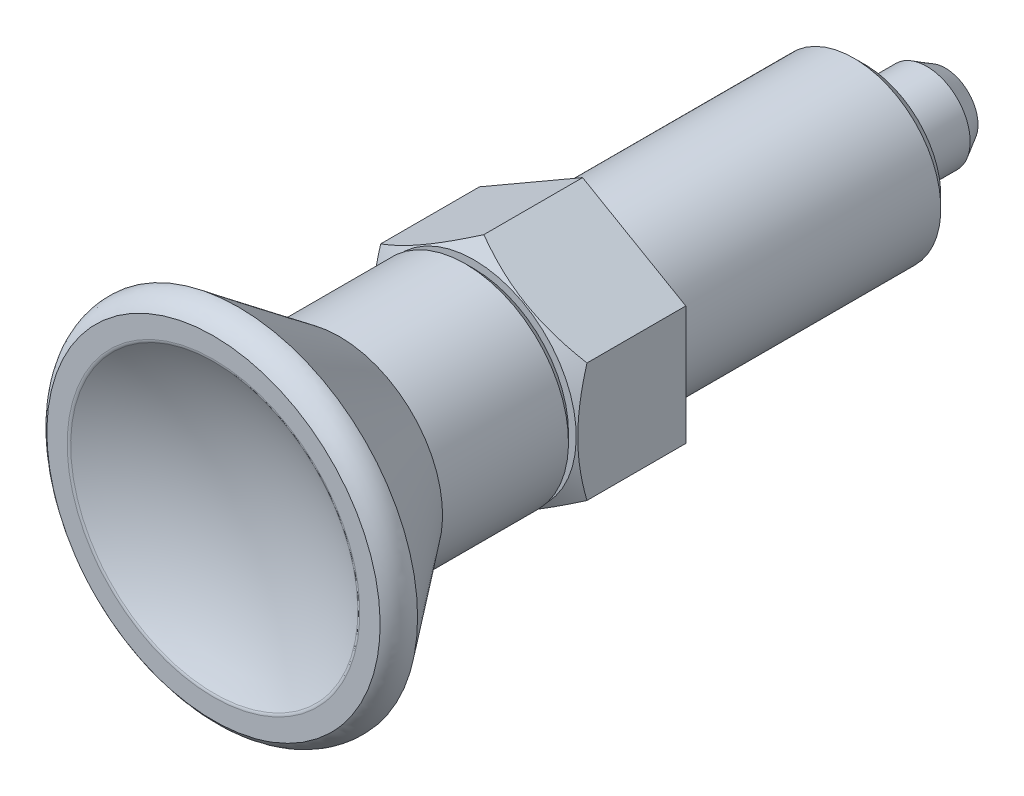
ISO-10303-21;
HEADER;
FILE_DESCRIPTION(('STEP AP214'),'2;1');
FILE_NAME('part.step','',(''),(''),'','','');
FILE_SCHEMA(('AUTOMOTIVE_DESIGN { 1 0 10303 214 1 1 1 1 }'));
ENDSEC;
DATA;
#1=APPLICATION_CONTEXT('core data for automotive mechanical design processes');
#2=APPLICATION_PROTOCOL_DEFINITION('international standard','automotive_design',2000,#1);
#3=PRODUCT_CONTEXT('',#1,'mechanical');
#4=PRODUCT('Part','Part','',(#3));
#5=PRODUCT_RELATED_PRODUCT_CATEGORY('part','',(#4));
#6=PRODUCT_DEFINITION_FORMATION('','',#4);
#7=PRODUCT_DEFINITION_CONTEXT('part definition',#1,'design');
#8=PRODUCT_DEFINITION('design','',#6,#7);
#9=PRODUCT_DEFINITION_SHAPE('','',#8);
#10=(LENGTH_UNIT() NAMED_UNIT(*) SI_UNIT(.MILLI.,.METRE.));
#11=(NAMED_UNIT(*) PLANE_ANGLE_UNIT() SI_UNIT($,.RADIAN.));
#12=(NAMED_UNIT(*) SI_UNIT($,.STERADIAN.) SOLID_ANGLE_UNIT());
#13=UNCERTAINTY_MEASURE_WITH_UNIT(LENGTH_MEASURE(1.E-05),#10,'distance_accuracy_value','');
#14=(GEOMETRIC_REPRESENTATION_CONTEXT(3) GLOBAL_UNCERTAINTY_ASSIGNED_CONTEXT((#13)) GLOBAL_UNIT_ASSIGNED_CONTEXT((#10,
#11,#12)) REPRESENTATION_CONTEXT('',''));
#15=CARTESIAN_POINT('',(0.,0.,0.));
#16=DIRECTION('',(0.,0.,1.));
#17=DIRECTION('',(1.,0.,0.));
#18=AXIS2_PLACEMENT_3D('',#15,#16,#17);
#19=CARTESIAN_POINT('',(0.,0.,-26.));
#20=DIRECTION('',(0.,0.,1.));
#21=DIRECTION('',(-1.,0.,0.));
#22=AXIS2_PLACEMENT_3D('',#19,#20,#21);
#23=CONICAL_SURFACE('',#22,7.,0.785398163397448);
#24=CARTESIAN_POINT('',(0.,0.,-25.));
#25=DIRECTION('',(0.,0.,-1.));
#26=DIRECTION('',(-1.,0.,0.));
#27=AXIS2_PLACEMENT_3D('',#24,#25,#26);
#28=CIRCLE('',#27,8.);
#29=CARTESIAN_POINT('',(-7.99999999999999,0.,-25.));
#30=VERTEX_POINT('',#29);
#31=EDGE_CURVE('E117',#30,#30,#28,.T.);
#32=ORIENTED_EDGE('',*,*,#31,.T.);
#33=EDGE_LOOP('',(#32));
#34=FACE_BOUND('',#33,.T.);
#35=CARTESIAN_POINT('',(0.,0.,-26.));
#36=DIRECTION('',(0.,0.,1.));
#37=DIRECTION('',(-1.,0.,0.));
#38=AXIS2_PLACEMENT_3D('',#35,#36,#37);
#39=CIRCLE('',#38,7.);
#40=CARTESIAN_POINT('',(-6.99999999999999,0.,-26.));
#41=VERTEX_POINT('',#40);
#42=EDGE_CURVE('E121',#41,#41,#39,.T.);
#43=ORIENTED_EDGE('',*,*,#42,.T.);
#44=EDGE_LOOP('',(#43));
#45=FACE_BOUND('',#44,.T.);
#46=ADVANCED_FACE('F14',(#34,#45),#23,.T.);
#47=CARTESIAN_POINT('',(0.,0.,0.));
#48=DIRECTION('',(0.,0.,-1.));
#49=DIRECTION('',(-1.,0.,0.));
#50=AXIS2_PLACEMENT_3D('',#47,#48,#49);
#51=CYLINDRICAL_SURFACE('',#50,8.);
#52=ORIENTED_EDGE('',*,*,#31,.F.);
#53=EDGE_LOOP('',(#52));
#54=FACE_BOUND('',#53,.T.);
#55=CARTESIAN_POINT('',(0.,0.,0.));
#56=DIRECTION('',(0.,0.,1.));
#57=DIRECTION('',(-1.,0.,0.));
#58=AXIS2_PLACEMENT_3D('',#55,#56,#57);
#59=CIRCLE('',#58,8.);
#60=CARTESIAN_POINT('',(-8.,0.,0.));
#61=VERTEX_POINT('',#60);
#62=EDGE_CURVE('E111',#61,#61,#59,.T.);
#63=ORIENTED_EDGE('',*,*,#62,.F.);
#64=EDGE_LOOP('',(#63));
#65=FACE_BOUND('',#64,.T.);
#66=ADVANCED_FACE('F175',(#54,#65),#51,.T.);
#67=CARTESIAN_POINT('',(-12.65,-12.65,0.));
#68=DIRECTION('',(0.,0.,-1.));
#69=DIRECTION('',(0.,1.,0.));
#70=AXIS2_PLACEMENT_3D('',#67,#68,#69);
#71=PLANE('',#70);
#72=DIRECTION('',(0.,-1.,0.));
#73=VECTOR('',#72,1.);
#74=CARTESIAN_POINT('',(9.50246374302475,5.48625,0.));
#75=LINE('',#74,#73);
#76=CARTESIAN_POINT('',(9.50246374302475,5.48625,0.));
#77=VERTEX_POINT('',#76);
#78=CARTESIAN_POINT('',(9.50246374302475,-5.48625,0.));
#79=VERTEX_POINT('',#78);
#80=EDGE_CURVE('E609',#77,#79,#75,.T.);
#81=ORIENTED_EDGE('',*,*,#80,.T.);
#82=DIRECTION('',(-0.866025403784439,-0.5,0.));
#83=VECTOR('',#82,1.);
#84=CARTESIAN_POINT('',(9.50246374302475,-5.48625,0.));
#85=LINE('',#84,#83);
#86=CARTESIAN_POINT('',(0.,-10.9725,0.));
#87=VERTEX_POINT('',#86);
#88=EDGE_CURVE('E615',#79,#87,#85,.T.);
#89=ORIENTED_EDGE('',*,*,#88,.T.);
#90=DIRECTION('',(-0.866025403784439,0.5,0.));
#91=VECTOR('',#90,1.);
#92=CARTESIAN_POINT('',(0.,-10.9725,0.));
#93=LINE('',#92,#91);
#94=CARTESIAN_POINT('',(-9.50246374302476,-5.48625,0.));
#95=VERTEX_POINT('',#94);
#96=EDGE_CURVE('E81',#87,#95,#93,.T.);
#97=ORIENTED_EDGE('',*,*,#96,.T.);
#98=DIRECTION('',(0.,1.,0.));
#99=VECTOR('',#98,1.);
#100=CARTESIAN_POINT('',(-9.50246374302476,-5.48625,0.));
#101=LINE('',#100,#99);
#102=CARTESIAN_POINT('',(-9.50246374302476,5.48625,0.));
#103=VERTEX_POINT('',#102);
#104=EDGE_CURVE('E86',#95,#103,#101,.T.);
#105=ORIENTED_EDGE('',*,*,#104,.T.);
#106=DIRECTION('',(0.866025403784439,0.5,0.));
#107=VECTOR('',#106,1.);
#108=CARTESIAN_POINT('',(-9.50246374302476,5.48625,0.));
#109=LINE('',#108,#107);
#110=CARTESIAN_POINT('',(0.,10.9725,0.));
#111=VERTEX_POINT('',#110);
#112=EDGE_CURVE('E90',#103,#111,#109,.T.);
#113=ORIENTED_EDGE('',*,*,#112,.T.);
#114=DIRECTION('',(0.866025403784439,-0.5,0.));
#115=VECTOR('',#114,1.);
#116=CARTESIAN_POINT('',(0.,10.9725,0.));
#117=LINE('',#116,#115);
#118=EDGE_CURVE('E106',#111,#77,#117,.T.);
#119=ORIENTED_EDGE('',*,*,#118,.T.);
#120=EDGE_LOOP('',(#81,#89,#97,#105,#113,#119));
#121=FACE_BOUND('',#120,.T.);
#122=ORIENTED_EDGE('',*,*,#62,.T.);
#123=EDGE_LOOP('',(#122));
#124=FACE_BOUND('',#123,.T.);
#125=ADVANCED_FACE('F87',(#121,#124),#71,.T.);
#126=CARTESIAN_POINT('',(9.50246374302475,-5.48625,10.));
#127=DIRECTION('',(-1.,0.,0.));
#128=DIRECTION('',(0.,1.,0.));
#129=AXIS2_PLACEMENT_3D('',#126,#127,#128);
#130=PLANE('',#129);
#131=DIRECTION('',(0.,0.,-1.));
#132=VECTOR('',#131,1.);
#133=CARTESIAN_POINT('',(9.50246374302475,-5.48625,9.1));
#134=LINE('',#133,#132);
#135=CARTESIAN_POINT('',(9.50246374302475,-5.48625,9.1));
#136=VERTEX_POINT('',#135);
#137=EDGE_CURVE('E575',#136,#79,#134,.T.);
#138=ORIENTED_EDGE('',*,*,#137,.T.);
#139=ORIENTED_EDGE('',*,*,#80,.F.);
#140=DIRECTION('',(0.,0.,1.));
#141=VECTOR('',#140,1.);
#142=CARTESIAN_POINT('',(9.50246374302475,5.48625,0.));
#143=LINE('',#142,#141);
#144=CARTESIAN_POINT('',(9.50246374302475,5.48625,9.1));
#145=VERTEX_POINT('',#144);
#146=EDGE_CURVE('E582',#77,#145,#143,.T.);
#147=ORIENTED_EDGE('',*,*,#146,.T.);
#148=CARTESIAN_POINT('',(9.50246374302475,-5.48625,9.1));
#149=CARTESIAN_POINT('',(9.50246374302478,0.,10.6837439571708));
#150=CARTESIAN_POINT('',(9.50246374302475,5.48625,9.1));
#151=(BOUNDED_CURVE() B_SPLINE_CURVE(2,(#148,#149,#150),.UNSPECIFIED.,.F.,
.F.) B_SPLINE_CURVE_WITH_KNOTS((3,3),(0.,1.),
.UNSPECIFIED.) CURVE() GEOMETRIC_REPRESENTATION_ITEM() RATIONAL_B_SPLINE_CURVE((1.,
1.15470053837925,1.)) REPRESENTATION_ITEM(''));
#152=EDGE_CURVE('E561',#136,#145,#151,.T.);
#153=ORIENTED_EDGE('',*,*,#152,.F.);
#154=EDGE_LOOP('',(#138,#139,#147,#153));
#155=FACE_BOUND('',#154,.T.);
#156=ADVANCED_FACE('F317',(#155),#130,.F.);
#157=CARTESIAN_POINT('',(0.,-10.9725,10.));
#158=DIRECTION('',(-0.5,0.866025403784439,0.));
#159=DIRECTION('',(0.866025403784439,0.5,0.));
#160=AXIS2_PLACEMENT_3D('',#157,#158,#159);
#161=PLANE('',#160);
#162=DIRECTION('',(0.,0.,-1.));
#163=VECTOR('',#162,1.);
#164=CARTESIAN_POINT('',(0.,-10.9725,9.1));
#165=LINE('',#164,#163);
#166=CARTESIAN_POINT('',(0.,-10.9725,9.1));
#167=VERTEX_POINT('',#166);
#168=EDGE_CURVE('E589',#167,#87,#165,.T.);
#169=ORIENTED_EDGE('',*,*,#168,.T.);
#170=ORIENTED_EDGE('',*,*,#88,.F.);
#171=ORIENTED_EDGE('',*,*,#137,.F.);
#172=CARTESIAN_POINT('',(0.,-10.9725,9.1));
#173=CARTESIAN_POINT('',(4.75123187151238,-8.22937499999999,10.6837439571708));
#174=CARTESIAN_POINT('',(9.50246374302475,-5.48625,9.1));
#175=(BOUNDED_CURVE() B_SPLINE_CURVE(2,(#172,#173,#174),.UNSPECIFIED.,.F.,
.F.) B_SPLINE_CURVE_WITH_KNOTS((3,3),(0.,1.),
.UNSPECIFIED.) CURVE() GEOMETRIC_REPRESENTATION_ITEM() RATIONAL_B_SPLINE_CURVE((1.,
1.15470053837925,1.)) REPRESENTATION_ITEM(''));
#176=EDGE_CURVE('E554',#167,#136,#175,.T.);
#177=ORIENTED_EDGE('',*,*,#176,.F.);
#178=EDGE_LOOP('',(#169,#170,#171,#177));
#179=FACE_BOUND('',#178,.T.);
#180=ADVANCED_FACE('F341',(#179),#161,.F.);
#181=CARTESIAN_POINT('',(-9.50246374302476,-5.48625,10.));
#182=DIRECTION('',(0.5,0.866025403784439,0.));
#183=DIRECTION('',(0.866025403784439,-0.5,0.));
#184=AXIS2_PLACEMENT_3D('',#181,#182,#183);
#185=PLANE('',#184);
#186=DIRECTION('',(0.,0.,-1.));
#187=VECTOR('',#186,1.);
#188=CARTESIAN_POINT('',(-9.50246374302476,-5.48625,9.1));
#189=LINE('',#188,#187);
#190=CARTESIAN_POINT('',(-9.50246374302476,-5.48625,9.1));
#191=VERTEX_POINT('',#190);
#192=EDGE_CURVE('E99',#191,#95,#189,.T.);
#193=ORIENTED_EDGE('',*,*,#192,.T.);
#194=ORIENTED_EDGE('',*,*,#96,.F.);
#195=ORIENTED_EDGE('',*,*,#168,.F.);
#196=CARTESIAN_POINT('',(-9.50246374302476,-5.48625,9.1));
#197=CARTESIAN_POINT('',(-4.75123187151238,-8.22937499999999,10.6837439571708));
#198=CARTESIAN_POINT('',(0.,-10.9725,9.1));
#199=(BOUNDED_CURVE() B_SPLINE_CURVE(2,(#196,#197,#198),.UNSPECIFIED.,.F.,
.F.) B_SPLINE_CURVE_WITH_KNOTS((3,3),(0.,1.),
.UNSPECIFIED.) CURVE() GEOMETRIC_REPRESENTATION_ITEM() RATIONAL_B_SPLINE_CURVE((1.,
1.15470053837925,1.)) REPRESENTATION_ITEM(''));
#200=EDGE_CURVE('E547',#191,#167,#199,.T.);
#201=ORIENTED_EDGE('',*,*,#200,.F.);
#202=EDGE_LOOP('',(#193,#194,#195,#201));
#203=FACE_BOUND('',#202,.T.);
#204=ADVANCED_FACE('F353',(#203),#185,.F.);
#205=CARTESIAN_POINT('',(-9.50246374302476,5.48625,10.));
#206=DIRECTION('',(1.,0.,0.));
#207=DIRECTION('',(0.,-1.,0.));
#208=AXIS2_PLACEMENT_3D('',#205,#206,#207);
#209=PLANE('',#208);
#210=DIRECTION('',(0.,0.,-1.));
#211=VECTOR('',#210,1.);
#212=CARTESIAN_POINT('',(-9.50246374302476,5.48625,9.1));
#213=LINE('',#212,#211);
#214=CARTESIAN_POINT('',(-9.50246374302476,5.48625,9.1));
#215=VERTEX_POINT('',#214);
#216=EDGE_CURVE('E94',#215,#103,#213,.T.);
#217=ORIENTED_EDGE('',*,*,#216,.T.);
#218=ORIENTED_EDGE('',*,*,#104,.F.);
#219=ORIENTED_EDGE('',*,*,#192,.F.);
#220=CARTESIAN_POINT('',(-9.50246374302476,5.48625,9.1));
#221=CARTESIAN_POINT('',(-9.50246374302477,0.,10.6837439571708));
#222=CARTESIAN_POINT('',(-9.50246374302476,-5.48625,9.1));
#223=(BOUNDED_CURVE() B_SPLINE_CURVE(2,(#220,#221,#222),.UNSPECIFIED.,.F.,
.F.) B_SPLINE_CURVE_WITH_KNOTS((3,3),(0.,1.),
.UNSPECIFIED.) CURVE() GEOMETRIC_REPRESENTATION_ITEM() RATIONAL_B_SPLINE_CURVE((1.,
1.15470053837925,1.)) REPRESENTATION_ITEM(''));
#224=EDGE_CURVE('E39',#215,#191,#223,.T.);
#225=ORIENTED_EDGE('',*,*,#224,.F.);
#226=EDGE_LOOP('',(#217,#218,#219,#225));
#227=FACE_BOUND('',#226,.T.);
#228=ADVANCED_FACE('F95',(#227),#209,.F.);
#229=CARTESIAN_POINT('',(0.,10.9725,10.));
#230=DIRECTION('',(0.5,-0.866025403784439,0.));
#231=DIRECTION('',(-0.866025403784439,-0.5,0.));
#232=AXIS2_PLACEMENT_3D('',#229,#230,#231);
#233=PLANE('',#232);
#234=DIRECTION('',(0.,0.,-1.));
#235=VECTOR('',#234,1.);
#236=CARTESIAN_POINT('',(0.,10.9725,9.1));
#237=LINE('',#236,#235);
#238=CARTESIAN_POINT('',(0.,10.9725,9.1));
#239=VERTEX_POINT('',#238);
#240=EDGE_CURVE('E100',#239,#111,#237,.T.);
#241=ORIENTED_EDGE('',*,*,#240,.T.);
#242=ORIENTED_EDGE('',*,*,#112,.F.);
#243=ORIENTED_EDGE('',*,*,#216,.F.);
#244=CARTESIAN_POINT('',(0.,10.9725,9.1));
#245=CARTESIAN_POINT('',(-4.75123187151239,8.22937500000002,10.6837439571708));
#246=CARTESIAN_POINT('',(-9.50246374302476,5.48625,9.1));
#247=(BOUNDED_CURVE() B_SPLINE_CURVE(2,(#244,#245,#246),.UNSPECIFIED.,.F.,
.F.) B_SPLINE_CURVE_WITH_KNOTS((3,3),(0.,1.),
.UNSPECIFIED.) CURVE() GEOMETRIC_REPRESENTATION_ITEM() RATIONAL_B_SPLINE_CURVE((1.,
1.15470053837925,1.)) REPRESENTATION_ITEM(''));
#248=EDGE_CURVE('E536',#239,#215,#247,.T.);
#249=ORIENTED_EDGE('',*,*,#248,.F.);
#250=EDGE_LOOP('',(#241,#242,#243,#249));
#251=FACE_BOUND('',#250,.T.);
#252=ADVANCED_FACE('F103',(#251),#233,.F.);
#253=CARTESIAN_POINT('',(9.50246374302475,5.48625,10.));
#254=DIRECTION('',(-0.5,-0.866025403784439,0.));
#255=DIRECTION('',(-0.866025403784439,0.5,0.));
#256=AXIS2_PLACEMENT_3D('',#253,#254,#255);
#257=PLANE('',#256);
#258=ORIENTED_EDGE('',*,*,#146,.F.);
#259=ORIENTED_EDGE('',*,*,#118,.F.);
#260=ORIENTED_EDGE('',*,*,#240,.F.);
#261=CARTESIAN_POINT('',(9.50246374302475,5.48625,9.1));
#262=CARTESIAN_POINT('',(4.75123187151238,8.22937499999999,10.6837439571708));
#263=CARTESIAN_POINT('',(0.,10.9725,9.1));
#264=(BOUNDED_CURVE() B_SPLINE_CURVE(2,(#261,#262,#263),.UNSPECIFIED.,.F.,
.F.) B_SPLINE_CURVE_WITH_KNOTS((3,3),(0.,1.),
.UNSPECIFIED.) CURVE() GEOMETRIC_REPRESENTATION_ITEM() RATIONAL_B_SPLINE_CURVE((1.,
1.15470053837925,1.)) REPRESENTATION_ITEM(''));
#265=EDGE_CURVE('E568',#145,#239,#264,.T.);
#266=ORIENTED_EDGE('',*,*,#265,.F.);
#267=EDGE_LOOP('',(#258,#259,#260,#266));
#268=FACE_BOUND('',#267,.T.);
#269=ADVANCED_FACE('F318',(#268),#257,.F.);
#270=CARTESIAN_POINT('',(0.,0.,10.));
#271=DIRECTION('',(0.,0.,-1.));
#272=DIRECTION('',(0.,1.,0.));
#273=AXIS2_PLACEMENT_3D('',#270,#271,#272);
#274=CONICAL_SURFACE('',#273,9.41365427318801,1.0471975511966);
#275=ORIENTED_EDGE('',*,*,#248,.T.);
#276=ORIENTED_EDGE('',*,*,#224,.T.);
#277=ORIENTED_EDGE('',*,*,#200,.T.);
#278=ORIENTED_EDGE('',*,*,#176,.T.);
#279=ORIENTED_EDGE('',*,*,#152,.T.);
#280=ORIENTED_EDGE('',*,*,#265,.T.);
#281=EDGE_LOOP('',(#275,#276,#277,#278,#279,#280));
#282=FACE_BOUND('',#281,.T.);
#283=CARTESIAN_POINT('',(0.,0.,10.));
#284=DIRECTION('',(0.,0.,1.));
#285=DIRECTION('',(0.,1.,0.));
#286=AXIS2_PLACEMENT_3D('',#283,#284,#285);
#287=CIRCLE('',#286,9.41365427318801);
#288=CARTESIAN_POINT('',(0.,9.41365427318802,10.));
#289=VERTEX_POINT('',#288);
#290=EDGE_CURVE('E128',#289,#289,#287,.T.);
#291=ORIENTED_EDGE('',*,*,#290,.F.);
#292=EDGE_LOOP('',(#291));
#293=FACE_BOUND('',#292,.T.);
#294=ADVANCED_FACE('F328',(#282,#293),#274,.T.);
#295=CARTESIAN_POINT('',(12.65,-12.65,10.));
#296=DIRECTION('',(0.,0.,1.));
#297=DIRECTION('',(0.,1.,0.));
#298=AXIS2_PLACEMENT_3D('',#295,#296,#297);
#299=PLANE('',#298);
#300=CARTESIAN_POINT('',(0.,0.,10.));
#301=DIRECTION('',(0.,0.,1.));
#302=DIRECTION('',(1.,0.,0.));
#303=AXIS2_PLACEMENT_3D('',#300,#301,#302);
#304=CIRCLE('',#303,8.7);
#305=CARTESIAN_POINT('',(8.69999999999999,0.,10.));
#306=VERTEX_POINT('',#305);
#307=EDGE_CURVE('E126',#306,#306,#304,.T.);
#308=ORIENTED_EDGE('',*,*,#307,.F.);
#309=EDGE_LOOP('',(#308));
#310=FACE_BOUND('',#309,.T.);
#311=ORIENTED_EDGE('',*,*,#290,.T.);
#312=EDGE_LOOP('',(#311));
#313=FACE_BOUND('',#312,.T.);
#314=ADVANCED_FACE('F394',(#310,#313),#299,.T.);
#315=CARTESIAN_POINT('',(0.,0.,10.));
#316=DIRECTION('',(0.,0.,1.));
#317=DIRECTION('',(0.,1.,0.));
#318=AXIS2_PLACEMENT_3D('',#315,#316,#317);
#319=CONICAL_SURFACE('',#318,8.7,0.785398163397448);
#320=CARTESIAN_POINT('',(0.,0.,10.8));
#321=DIRECTION('',(0.,0.,1.));
#322=DIRECTION('',(0.,1.,0.));
#323=AXIS2_PLACEMENT_3D('',#320,#321,#322);
#324=CIRCLE('',#323,9.5);
#325=CARTESIAN_POINT('',(0.,9.49999999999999,10.8));
#326=VERTEX_POINT('',#325);
#327=EDGE_CURVE('E125',#326,#326,#324,.T.);
#328=ORIENTED_EDGE('',*,*,#327,.F.);
#329=EDGE_LOOP('',(#328));
#330=FACE_BOUND('',#329,.T.);
#331=ORIENTED_EDGE('',*,*,#307,.T.);
#332=EDGE_LOOP('',(#331));
#333=FACE_BOUND('',#332,.T.);
#334=ADVANCED_FACE('F406',(#330,#333),#319,.T.);
#335=CARTESIAN_POINT('',(0.,0.,22.4));
#336=DIRECTION('',(0.,0.,-1.));
#337=DIRECTION('',(0.,1.,0.));
#338=AXIS2_PLACEMENT_3D('',#335,#336,#337);
#339=CYLINDRICAL_SURFACE('',#338,9.5);
#340=ORIENTED_EDGE('',*,*,#327,.T.);
#341=EDGE_LOOP('',(#340));
#342=FACE_BOUND('',#341,.T.);
#343=CARTESIAN_POINT('',(0.,0.,22.4));
#344=DIRECTION('',(0.,0.,-1.));
#345=DIRECTION('',(0.,1.,0.));
#346=AXIS2_PLACEMENT_3D('',#343,#344,#345);
#347=CIRCLE('',#346,9.5);
#348=CARTESIAN_POINT('',(0.,9.5,22.4));
#349=VERTEX_POINT('',#348);
#350=EDGE_CURVE('E648',#349,#349,#347,.T.);
#351=ORIENTED_EDGE('',*,*,#350,.T.);
#352=EDGE_LOOP('',(#351));
#353=FACE_BOUND('',#352,.T.);
#354=ADVANCED_FACE('F465',(#342,#353),#339,.T.);
#355=CARTESIAN_POINT('',(0.,0.,22.4));
#356=DIRECTION('',(0.,0.,1.));
#357=DIRECTION('',(0.,1.,0.));
#358=AXIS2_PLACEMENT_3D('',#355,#356,#357);
#359=CONICAL_SURFACE('',#358,9.5,0.645219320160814);
#360=CARTESIAN_POINT('',(0.,0.,31.7));
#361=DIRECTION('',(0.,0.,1.));
#362=DIRECTION('',(0.,1.,0.));
#363=AXIS2_PLACEMENT_3D('',#360,#361,#362);
#364=CIRCLE('',#363,16.5);
#365=CARTESIAN_POINT('',(0.,16.5,31.7));
#366=VERTEX_POINT('',#365);
#367=EDGE_CURVE('E662',#366,#366,#364,.T.);
#368=ORIENTED_EDGE('',*,*,#367,.F.);
#369=EDGE_LOOP('',(#368));
#370=FACE_BOUND('',#369,.T.);
#371=ORIENTED_EDGE('',*,*,#350,.F.);
#372=EDGE_LOOP('',(#371));
#373=FACE_BOUND('',#372,.T.);
#374=ADVANCED_FACE('F453',(#370,#373),#359,.T.);
#375=CARTESIAN_POINT('',(0.,15.35,34.));
#376=CARTESIAN_POINT('',(0.,16.615654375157,33.1898669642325));
#377=CARTESIAN_POINT('',(0.,16.5,31.7));
#378=CARTESIAN_POINT('',(26.5869798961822,15.35,34.));
#379=CARTESIAN_POINT('',(28.779157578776,16.615654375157,33.1898669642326));
#380=CARTESIAN_POINT('',(28.5788383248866,16.5,31.7));
#381=CARTESIAN_POINT('',(13.2934899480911,-7.675,34.));
#382=CARTESIAN_POINT('',(14.389578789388,-8.30782718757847,33.1898669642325));
#383=CARTESIAN_POINT('',(14.2894191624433,-8.25,31.7));
#384=CARTESIAN_POINT('',(0.,-30.7,34.));
#385=CARTESIAN_POINT('',(0.,-33.2313087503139,33.1898669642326));
#386=CARTESIAN_POINT('',(0.,-33.,31.7));
#387=CARTESIAN_POINT('',(-13.2934899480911,-7.675,34.));
#388=CARTESIAN_POINT('',(-14.389578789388,-8.30782718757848,33.1898669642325));
#389=CARTESIAN_POINT('',(-14.2894191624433,-8.25,31.7));
#390=CARTESIAN_POINT('',(-26.5869798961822,15.35,34.));
#391=CARTESIAN_POINT('',(-28.779157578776,16.615654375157,33.1898669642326));
#392=CARTESIAN_POINT('',(-28.5788383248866,16.5,31.7));
#393=CARTESIAN_POINT('',(0.,15.35,34.));
#394=CARTESIAN_POINT('',(0.,16.615654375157,33.1898669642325));
#395=CARTESIAN_POINT('',(0.,16.5,31.7));
#396=(BOUNDED_SURFACE() B_SPLINE_SURFACE(2,2,((#375,#376,#377),(#378,#379,#380),(#381,#382,
#383),(#384,#385,#386),(#387,#388,#389),(#390,#391,#392),(#393,#394,#395)),.UNSPECIFIED.,.T.,
.F.,.F.) B_SPLINE_SURFACE_WITH_KNOTS((3,2,2,3),(3,3),(0.,18.7749492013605,37.5498984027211,
56.3248476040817),(0.,1.),
.UNSPECIFIED.) GEOMETRIC_REPRESENTATION_ITEM() RATIONAL_B_SPLINE_SURFACE(((1.,0.857079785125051,
1.),(0.5,0.428539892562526,0.5),(1.,0.857079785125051,1.),(0.5,0.428539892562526,0.5),(1.,
0.857079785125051,1.),(0.5,0.428539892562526,0.5),(1.,0.857079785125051,1.))) REPRESENTATION_ITEM('') SURFACE());
#397=CARTESIAN_POINT('',(0.,0.,34.));
#398=DIRECTION('',(0.,0.,-1.));
#399=DIRECTION('',(0.,1.,0.));
#400=AXIS2_PLACEMENT_3D('',#397,#398,#399);
#401=CIRCLE('',#400,15.35);
#402=CARTESIAN_POINT('',(0.,15.35,34.));
#403=VERTEX_POINT('',#402);
#404=EDGE_CURVE('E655',#403,#403,#401,.T.);
#405=CARTESIAN_POINT('',(0.,15.35,34.));
#406=CARTESIAN_POINT('',(0.,15.3556561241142,33.9963795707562));
#407=CARTESIAN_POINT('',(0.,15.3612977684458,33.992736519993));
#408=CARTESIAN_POINT('',(0.,15.3725641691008,33.9853973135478));
#409=CARTESIAN_POINT('',(0.,15.3781888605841,33.9817010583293));
#410=CARTESIAN_POINT('',(0.,15.3894206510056,33.9742554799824));
#411=CARTESIAN_POINT('',(0.,15.395027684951,33.9705060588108));
#412=CARTESIAN_POINT('',(0.,15.4062234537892,33.9629541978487));
#413=CARTESIAN_POINT('',(0.,15.4118121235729,33.9591516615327));
#414=CARTESIAN_POINT('',(0.,15.4229704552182,33.9514936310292));
#415=CARTESIAN_POINT('',(0.,15.4285400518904,33.9476380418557));
#416=CARTESIAN_POINT('',(0.,15.4396595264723,33.9398739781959));
#417=CARTESIAN_POINT('',(0.,15.4452093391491,33.9359654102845));
#418=CARTESIAN_POINT('',(0.,15.4562885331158,33.92809547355));
#419=CARTESIAN_POINT('',(0.,15.4618178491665,33.9241340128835));
#420=CARTESIAN_POINT('',(0.,15.4728553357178,33.9161583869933));
#421=CARTESIAN_POINT('',(0.,15.4783634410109,33.9121441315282));
#422=CARTESIAN_POINT('',(0.,15.489357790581,33.9040630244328));
#423=CARTESIAN_POINT('',(0.,15.4948439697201,33.8999960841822));
#424=CARTESIAN_POINT('',(0.,15.5057937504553,33.8918097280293));
#425=CARTESIAN_POINT('',(0.,15.5112572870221,33.8876902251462));
#426=CARTESIAN_POINT('',(0.,15.5221610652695,33.8793988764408));
#427=CARTESIAN_POINT('',(0.,15.527601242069,33.8752269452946));
#428=CARTESIAN_POINT('',(0.,15.538457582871,33.8668308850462));
#429=CARTESIAN_POINT('',(0.,15.5438736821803,33.8626066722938));
#430=CARTESIAN_POINT('',(0.,15.5546811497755,33.8541062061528));
#431=CARTESIAN_POINT('',(0.,15.5600724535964,33.8498298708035));
#432=CARTESIAN_POINT('',(0.,15.5708296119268,33.8412253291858));
#433=CARTESIAN_POINT('',(0.,15.5761954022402,33.8368970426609));
#434=CARTESIAN_POINT('',(0.,15.5869008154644,33.8281887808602));
#435=CARTESIAN_POINT('',(0.,15.592240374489,33.8238087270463));
#436=CARTESIAN_POINT('',(0.,15.6028926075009,33.8149971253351));
#437=CARTESIAN_POINT('',(0.,15.6082052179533,33.810565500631));
#438=CARTESIAN_POINT('',(0.,15.6188028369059,33.8016509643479));
#439=CARTESIAN_POINT('',(0.,15.6240877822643,33.7971679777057));
#440=CARTESIAN_POINT('',(0.,15.634629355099,33.7881509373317));
#441=CARTESIAN_POINT('',(0.,15.6398859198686,33.783616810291));
#442=CARTESIAN_POINT('',(0.,15.6503700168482,33.7744977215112));
#443=CARTESIAN_POINT('',(0.,15.655597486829,33.7699126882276));
#444=CARTESIAN_POINT('',(0.,15.6660226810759,33.7606920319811));
#445=CARTESIAN_POINT('',(0.,15.6712203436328,33.7560563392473));
#446=CARTESIAN_POINT('',(0.,15.6815852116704,33.7467346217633));
#447=CARTESIAN_POINT('',(0.,15.6867523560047,33.742048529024));
#448=CARTESIAN_POINT('',(0.,15.6970554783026,33.732626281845));
#449=CARTESIAN_POINT('',(0.,15.7021913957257,33.7278900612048));
#450=CARTESIAN_POINT('',(0.,15.7124313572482,33.7183678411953));
#451=CARTESIAN_POINT('',(0.,15.717535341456,33.71358177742));
#452=CARTESIAN_POINT('',(0.,15.7277107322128,33.7039601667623));
#453=CARTESIAN_POINT('',(0.,15.7327820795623,33.6991245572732));
#454=CARTESIAN_POINT('',(0.,15.7428914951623,33.689404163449));
#455=CARTESIAN_POINT('',(0.,15.7479295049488,33.6845193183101));
#456=CARTESIAN_POINT('',(0.,15.7579715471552,33.6747007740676));
#457=CARTESIAN_POINT('',(0.,15.7629755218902,33.6697670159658));
#458=CARTESIAN_POINT('',(0.,15.7729487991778,33.6598509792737));
#459=CARTESIAN_POINT('',(0.,15.7779180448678,33.6548686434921));
#460=CARTESIAN_POINT('',(0.,15.7878211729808,33.6448557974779));
#461=CARTESIAN_POINT('',(0.,15.7927549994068,33.6398252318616));
#462=CARTESIAN_POINT('',(0.,15.8025866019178,33.6297162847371));
#463=CARTESIAN_POINT('',(0.,15.8074843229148,33.6246378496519));
#464=CARTESIAN_POINT('',(0.,15.817243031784,33.6144335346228));
#465=CARTESIAN_POINT('',(0.,15.8221039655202,33.6093076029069));
#466=CARTESIAN_POINT('',(0.,15.8317884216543,33.5990086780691));
#467=CARTESIAN_POINT('',(0.,15.8366118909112,33.593835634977));
#468=CARTESIAN_POINT('',(0.,15.8462207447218,33.5834428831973));
#469=CARTESIAN_POINT('',(0.,15.8510060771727,33.5782231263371));
#470=CARTESIAN_POINT('',(0.,15.8605379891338,33.5677373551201));
#471=CARTESIAN_POINT('',(0.,15.8652845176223,33.5624712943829));
#472=CARTESIAN_POINT('',(0.,15.8747381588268,33.5518933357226));
#473=CARTESIAN_POINT('',(0.,15.8794452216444,33.5465813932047));
#474=CARTESIAN_POINT('',(0.,15.8888192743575,33.535912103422));
#475=CARTESIAN_POINT('',(0.,15.8934862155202,33.5305547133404));
#476=CARTESIAN_POINT('',(0.,15.9027793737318,33.5197949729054));
#477=CARTESIAN_POINT('',(0.,15.9074055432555,33.5143925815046));
#478=CARTESIAN_POINT('',(0.,15.9166165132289,33.5035432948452));
#479=CARTESIAN_POINT('',(0.,15.9212012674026,33.4980963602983));
#480=CARTESIAN_POINT('',(0.,15.9303287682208,33.4871584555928));
#481=CARTESIAN_POINT('',(0.,15.9348714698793,33.4816674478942));
#482=CARTESIAN_POINT('',(0.,15.9439142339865,33.4706418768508));
#483=CARTESIAN_POINT('',(0.,15.9484142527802,33.4651072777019));
#484=CARTESIAN_POINT('',(0.,15.9573710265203,33.4539950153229));
#485=CARTESIAN_POINT('',(0.,15.9618277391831,33.448417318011));
#486=CARTESIAN_POINT('',(0.,15.9706972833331,33.4372193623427));
#487=CARTESIAN_POINT('',(0.,15.9751100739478,33.4315990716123));
#488=CARTESIAN_POINT('',(0.,15.9838911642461,33.4203164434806));
#489=CARTESIAN_POINT('',(0.,15.9882594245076,33.4146540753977));
#490=CARTESIAN_POINT('',(0.,15.9969508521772,33.4032878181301));
#491=CARTESIAN_POINT('',(0.,16.0012739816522,33.3975838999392));
#492=CARTESIAN_POINT('',(0.,16.0098745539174,33.3861350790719));
#493=CARTESIAN_POINT('',(0.,16.0141519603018,33.3803901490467));
#494=CARTESIAN_POINT('',(0.,16.0226605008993,33.3688598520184));
#495=CARTESIAN_POINT('',(0.,16.0268916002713,33.3630744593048));
#496=CARTESIAN_POINT('',(0.,16.035306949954,33.3514637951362));
#497=CARTESIAN_POINT('',(0.,16.039491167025,33.3456384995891));
#498=CARTESIAN_POINT('',(0.,16.0478121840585,33.3339485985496));
#499=CARTESIAN_POINT('',(0.,16.0519489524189,33.3280839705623));
#500=CARTESIAN_POINT('',(0.,16.0601745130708,33.3163159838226));
#501=CARTESIAN_POINT('',(0.,16.0642632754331,33.3104126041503));
#502=CARTESIAN_POINT('',(0.,16.072392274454,33.2985677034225));
#503=CARTESIAN_POINT('',(0.,16.0764324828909,33.2926261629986));
#504=CARTESIAN_POINT('',(0.,16.0844638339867,33.2807055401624));
#505=CARTESIAN_POINT('',(0.,16.0884549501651,33.2747264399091));
#506=CARTESIAN_POINT('',(0.,16.0963875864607,33.2627313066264));
#507=CARTESIAN_POINT('',(0.,16.1003290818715,33.256715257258));
#508=CARTESIAN_POINT('',(0.,16.1081619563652,33.2446468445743));
#509=CARTESIAN_POINT('',(0.,16.1120533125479,33.2385944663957));
#510=CARTESIAN_POINT('',(0.,16.1197853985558,33.2264540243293));
#511=CARTESIAN_POINT('',(0.,16.1236261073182,33.2203659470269));
#512=CARTESIAN_POINT('',(0.,16.131256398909,33.2081547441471));
#513=CARTESIAN_POINT('',(0.,16.1350459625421,33.2020316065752));
#514=CARTESIAN_POINT('',(0.,16.1425734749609,33.189750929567));
#515=CARTESIAN_POINT('',(0.,16.1463114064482,33.1835933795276));
#516=CARTESIAN_POINT('',(0.,16.15373517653,33.1712445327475));
#517=CARTESIAN_POINT('',(0.,16.1574209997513,33.1650532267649));
#518=CARTESIAN_POINT('',(0.,16.1647400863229,33.1526375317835));
#519=CARTESIAN_POINT('',(0.,16.1683733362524,33.1464131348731));
#520=CARTESIAN_POINT('',(0.,16.175586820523,33.1339319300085));
#521=CARTESIAN_POINT('',(0.,16.179167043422,33.1276751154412));
#522=CARTESIAN_POINT('',(0.,16.1862740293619,33.1151297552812));
#523=CARTESIAN_POINT('',(0.,16.1898007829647,33.1088412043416));
#524=CARTESIAN_POINT('',(0.,16.196800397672,33.0962330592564));
#525=CARTESIAN_POINT('',(0.,16.2002732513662,33.0899134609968));
#526=CARTESIAN_POINT('',(0.,16.2071646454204,33.0772439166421));
#527=CARTESIAN_POINT('',(0.,16.210583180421,33.0708939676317));
#528=CARTESIAN_POINT('',(0.,16.2173655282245,33.0581644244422));
#529=CARTESIAN_POINT('',(0.,16.2207293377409,33.0517848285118));
#530=CARTESIAN_POINT('',(0.,16.2274018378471,33.038996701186));
#531=CARTESIAN_POINT('',(0.,16.2307105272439,33.032588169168));
#532=CARTESIAN_POINT('',(0.,16.237272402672,33.0197428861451));
#533=CARTESIAN_POINT('',(0.,16.2405255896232,33.01330613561));
#534=CARTESIAN_POINT('',(0.,16.2469760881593,33.0004051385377));
#535=CARTESIAN_POINT('',(0.,16.2501734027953,32.993940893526));
#536=CARTESIAN_POINT('',(0.,16.2565117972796,32.9809856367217));
#537=CARTESIAN_POINT('',(0.,16.2596528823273,32.9744946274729));
#538=CARTESIAN_POINT('',(0.,16.2658784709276,32.9614865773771));
#539=CARTESIAN_POINT('',(0.,16.2689629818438,32.9549695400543));
#540=CARTESIAN_POINT('',(0.,16.275075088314,32.9419101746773));
#541=CARTESIAN_POINT('',(0.,16.2781026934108,32.9353678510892));
#542=CARTESIAN_POINT('',(0.,16.2841006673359,32.9222586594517));
#543=CARTESIAN_POINT('',(0.,16.2870710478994,32.9156917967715));
#544=CARTESIAN_POINT('',(0.,16.2929542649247,32.9025342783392));
#545=CARTESIAN_POINT('',(0.,16.2958671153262,32.89594362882));
#546=CARTESIAN_POINT('',(0.,16.3016349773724,32.8827392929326));
#547=CARTESIAN_POINT('',(0.,16.3044900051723,32.8761256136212));
#548=CARTESIAN_POINT('',(0.,16.3101419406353,32.8628759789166));
#549=CARTESIAN_POINT('',(0.,16.3129388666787,32.856240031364));
#550=CARTESIAN_POINT('',(0.,16.3184743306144,32.8429466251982));
#551=CARTESIAN_POINT('',(0.,16.3212128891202,32.8362891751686));
#552=CARTESIAN_POINT('',(0.,16.3266313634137,32.8229535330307));
#553=CARTESIAN_POINT('',(0.,16.3293113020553,32.8162753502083));
#554=CARTESIAN_POINT('',(0.,16.3346122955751,32.8028990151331));
#555=CARTESIAN_POINT('',(0.,16.3372333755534,32.7962008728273));
#556=CARTESIAN_POINT('',(0.,16.3424164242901,32.7827853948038));
#557=CARTESIAN_POINT('',(0.,16.3449784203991,32.7760680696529));
#558=CARTESIAN_POINT('',(0.,16.3500430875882,32.7626150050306));
#559=CARTESIAN_POINT('',(0.,16.3525457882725,32.7558792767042));
#560=CARTESIAN_POINT('',(0.,16.357491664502,32.7423901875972));
#561=CARTESIAN_POINT('',(0.,16.3599348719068,32.7356368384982));
#562=CARTESIAN_POINT('',(0.,16.364761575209,32.7221132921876));
#563=CARTESIAN_POINT('',(0.,16.367145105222,32.7153431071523));
#564=CARTESIAN_POINT('',(0.,16.3718522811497,32.7017866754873));
#565=CARTESIAN_POINT('',(0.,16.3741759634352,32.6950004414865));
#566=CARTESIAN_POINT('',(0.,16.3787632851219,32.6814127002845));
#567=CARTESIAN_POINT('',(0.,16.3810269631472,32.6746112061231));
#568=CARTESIAN_POINT('',(0.,16.3854941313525,32.6609937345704));
#569=CARTESIAN_POINT('',(0.,16.3876976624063,32.6541777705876));
#570=CARTESIAN_POINT('',(0.,16.3920444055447,32.6405321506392));
#571=CARTESIAN_POINT('',(0.,16.3941876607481,32.6337025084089));
#572=CARTESIAN_POINT('',(0.,16.3984137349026,32.6200303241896));
#573=CARTESIAN_POINT('',(0.,16.4004965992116,32.6131877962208));
#574=CARTESIAN_POINT('',(0.,16.404601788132,32.5994906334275));
#575=CARTESIAN_POINT('',(0.,16.4066241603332,32.5926360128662));
#576=CARTESIAN_POINT('',(0.,16.4106082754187,32.5789154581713));
#577=CARTESIAN_POINT('',(0.,16.4125700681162,32.5720495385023));
#578=CARTESIAN_POINT('',(0.,16.4164329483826,32.5583071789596));
#579=CARTESIAN_POINT('',(0.,16.4183340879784,32.5514307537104));
#580=CARTESIAN_POINT('',(0.,16.4220756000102,32.5376681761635));
#581=CARTESIAN_POINT('',(0.,16.4239160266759,32.5307820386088));
#582=CARTESIAN_POINT('',(0.,16.4275360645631,32.5170008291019));
#583=CARTESIAN_POINT('',(0.,16.429315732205,32.5101057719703));
#584=CARTESIAN_POINT('',(0.,16.4328142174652,32.4963075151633));
#585=CARTESIAN_POINT('',(0.,16.4345330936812,32.4894043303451));
#586=CARTESIAN_POINT('',(0.,16.4379099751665,32.4755906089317));
#587=CARTESIAN_POINT('',(0.,16.4395680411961,32.4686800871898));
#588=CARTESIAN_POINT('',(0.,16.4428232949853,32.4548524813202));
#589=CARTESIAN_POINT('',(0.,16.4444205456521,32.447935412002));
#590=CARTESIAN_POINT('',(0.,16.4475541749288,32.4340954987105));
#591=CARTESIAN_POINT('',(0.,16.4490906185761,32.427172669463));
#592=CARTESIAN_POINT('',(0.,16.4521026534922,32.4133220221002));
#593=CARTESIAN_POINT('',(0.,16.4535783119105,32.4063942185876));
#594=CARTESIAN_POINT('',(0.,16.4564688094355,32.3925344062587));
#595=CARTESIAN_POINT('',(0.,16.4578837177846,32.385602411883));
#596=CARTESIAN_POINT('',(0.,16.4606527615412,32.3717349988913));
#597=CARTESIAN_POINT('',(0.,16.4620069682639,32.3647995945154));
#598=CARTESIAN_POINT('',(0.,16.46465466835,32.3509261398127));
#599=CARTESIAN_POINT('',(0.,16.4659482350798,32.3439881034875));
#600=CARTESIAN_POINT('',(0.,16.4684747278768,32.3301101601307));
#601=CARTESIAN_POINT('',(0.,16.4697077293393,32.3231702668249));
#602=CARTESIAN_POINT('',(0.,16.4721131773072,32.3092893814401));
#603=CARTESIAN_POINT('',(0.,16.4732857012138,32.3023484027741));
#604=CARTESIAN_POINT('',(0.,16.4755702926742,32.2884661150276));
#605=CARTESIAN_POINT('',(0.,16.4766824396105,32.2815248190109));
#606=CARTESIAN_POINT('',(0.,16.4788463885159,32.2676426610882));
#607=CARTESIAN_POINT('',(0.,16.4798982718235,32.2607018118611));
#608=CARTESIAN_POINT('',(0.,16.4819418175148,32.2468213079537));
#609=CARTESIAN_POINT('',(0.,16.4829335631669,32.2398816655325));
#610=CARTESIAN_POINT('',(0.,16.4848569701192,32.2260043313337));
#611=CARTESIAN_POINT('',(0.,16.4857887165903,32.2190666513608));
#612=CARTESIAN_POINT('',(0.,16.487592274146,32.2051939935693));
#613=CARTESIAN_POINT('',(0.,16.4884641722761,32.1982590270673));
#614=CARTESIAN_POINT('',(0.,16.4901481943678,32.1843925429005));
#615=CARTESIAN_POINT('',(0.,16.4909604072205,32.1774610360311));
#616=CARTESIAN_POINT('',(0.,16.4925252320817,32.1636022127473));
#617=CARTESIAN_POINT('',(0.,16.4932779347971,32.1566749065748));
#618=CARTESIAN_POINT('',(0.,16.4947239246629,32.1428252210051));
#619=CARTESIAN_POINT('',(0.,16.4954173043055,32.1359028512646));
#620=CARTESIAN_POINT('',(0.,16.4967448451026,32.1220637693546));
#621=CARTESIAN_POINT('',(0.,16.4973791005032,32.1151470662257));
#622=CARTESIAN_POINT('',(0.,16.4985886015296,32.101320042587));
#623=CARTESIAN_POINT('',(0.,16.4991639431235,32.0944097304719));
#624=CARTESIAN_POINT('',(0.,16.5002558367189,32.0805962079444));
#625=CARTESIAN_POINT('',(0.,16.5007724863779,32.0736930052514));
#626=CARTESIAN_POINT('',(0.,16.5017472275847,32.0598944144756));
#627=CARTESIAN_POINT('',(0.,16.5022054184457,32.0529990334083));
#628=CARTESIAN_POINT('',(0.,16.5030634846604,32.0392167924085));
#629=CARTESIAN_POINT('',(0.,16.503463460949,32.0323299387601));
#630=CARTESIAN_POINT('',(0.,16.5042053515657,32.0185654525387));
#631=CARTESIAN_POINT('',(0.,16.5045473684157,32.0116878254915));
#632=CARTESIAN_POINT('',(0.,16.5051736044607,31.9979424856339));
#633=CARTESIAN_POINT('',(0.,16.5054579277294,31.9910747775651));
#634=CARTESIAN_POINT('',(0.,16.5059690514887,31.9773499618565));
#635=CARTESIAN_POINT('',(0.,16.5061959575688,31.9704928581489));
#636=CARTESIAN_POINT('',(0.,16.5065925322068,31.9567899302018));
#637=CARTESIAN_POINT('',(0.,16.506762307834,31.9499441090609));
#638=CARTESIAN_POINT('',(0.,16.5070449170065,31.9362644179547));
#639=CARTESIAN_POINT('',(0.,16.507157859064,31.9294305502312));
#640=CARTESIAN_POINT('',(0.,16.5073271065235,31.9157754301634));
#641=CARTESIAN_POINT('',(0.,16.5073835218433,31.9089541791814));
#642=CARTESIAN_POINT('',(0.,16.5074400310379,31.8953249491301));
#643=CARTESIAN_POINT('',(0.,16.5074402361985,31.8885169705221));
#644=CARTESIAN_POINT('',(0.,16.5073846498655,31.874914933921));
#645=CARTESIAN_POINT('',(0.,16.5073289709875,31.8681208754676));
#646=CARTESIAN_POINT('',(0.,16.5071619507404,31.8545473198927));
#647=CARTESIAN_POINT('',(0.,16.5070507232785,31.8477678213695));
#648=CARTESIAN_POINT('',(0.,16.5067729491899,31.8342240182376));
#649=CARTESIAN_POINT('',(0.,16.5066065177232,31.827459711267));
#650=CARTESIAN_POINT('',(0.,16.5062186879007,31.8139469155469));
#651=CARTESIAN_POINT('',(0.,16.5059974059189,31.8071984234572));
#652=CARTESIAN_POINT('',(0.,16.5055002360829,31.7937178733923));
#653=CARTESIAN_POINT('',(0.,16.5052244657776,31.7869858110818));
#654=CARTESIAN_POINT('',(0.,16.5046186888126,31.7735387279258));
#655=CARTESIAN_POINT('',(0.,16.5042888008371,31.7668237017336));
#656=CARTESIAN_POINT('',(0.,16.503575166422,31.7534112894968));
#657=CARTESIAN_POINT('',(0.,16.503191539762,31.7467138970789));
#658=CARTESIAN_POINT('',(0.,16.5023708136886,31.7333373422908));
#659=CARTESIAN_POINT('',(0.,16.5019338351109,31.7266581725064));
#660=CARTESIAN_POINT('',(0.,16.5010067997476,31.713318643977));
#661=CARTESIAN_POINT('',(0.,16.5005168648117,31.7066582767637));
#662=CARTESIAN_POINT('',(0.,16.5,31.7));
#663=B_SPLINE_CURVE_WITH_KNOTS('',3,(#405,#406,#407,#408,#409,#410,#411,#412,#413,#414,#415,
#416,#417,#418,#419,#420,#421,#422,#423,#424,#425,#426,#427,#428,#429,#430,#431,#432,#433,#434,
#435,#436,#437,#438,#439,#440,#441,#442,#443,#444,#445,#446,#447,#448,#449,#450,#451,#452,#453,
#454,#455,#456,#457,#458,#459,#460,#461,#462,#463,#464,#465,#466,#467,#468,#469,#470,#471,#472,
#473,#474,#475,#476,#477,#478,#479,#480,#481,#482,#483,#484,#485,#486,#487,#488,#489,#490,#491,
#492,#493,#494,#495,#496,#497,#498,#499,#500,#501,#502,#503,#504,#505,#506,#507,#508,#509,#510,
#511,#512,#513,#514,#515,#516,#517,#518,#519,#520,#521,#522,#523,#524,#525,#526,#527,#528,#529,
#530,#531,#532,#533,#534,#535,#536,#537,#538,#539,#540,#541,#542,#543,#544,#545,#546,#547,#548,
#549,#550,#551,#552,#553,#554,#555,#556,#557,#558,#559,#560,#561,#562,#563,#564,#565,#566,#567,
#568,#569,#570,#571,#572,#573,#574,#575,#576,#577,#578,#579,#580,#581,#582,#583,#584,#585,#586,
#587,#588,#589,#590,#591,#592,#593,#594,#595,#596,#597,#598,#599,#600,#601,#602,#603,#604,#605,
#606,#607,#608,#609,#610,#611,#612,#613,#614,#615,#616,#617,#618,#619,#620,#621,#622,#623,#624,
#625,#626,#627,#628,#629,#630,#631,#632,#633,#634,#635,#636,#637,#638,#639,#640,#641,#642,#643,
#644,#645,#646,#647,#648,#649,#650,#651,#652,#653,#654,#655,#656,#657,#658,#659,#660,#661,#662),
.UNSPECIFIED.,.F.,.F.,(4,2,2,2,2,2,2,2,2,2,2,2,2,2,2,2,2,2,2,2,2,2,2,2,2,2,2,2,2,2,2,2,2,2,2,2,
2,2,2,2,2,2,2,2,2,2,2,2,2,2,2,2,2,2,2,2,2,2,2,2,2,2,2,2,2,2,2,2,2,2,2,2,2,2,2,2,2,2,2,2,2,2,2,2,
2,2,2,2,2,2,2,2,2,2,2,2,2,2,2,2,2,2,2,2,2,2,2,2,2,2,2,2,2,2,2,2,2,2,2,2,2,2,2,2,2,2,2,2,4),(0.,
0.020146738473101,0.0403379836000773,0.0605732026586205,0.0808518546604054,0.101173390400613,
0.121537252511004,0.141942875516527,0.162389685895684,0.182877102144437,0.203404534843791,
0.223971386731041,0.244577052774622,0.265220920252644,0.285902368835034,0.306620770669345,
0.327375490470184,0.348165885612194,0.368991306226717,0.389851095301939,0.41074458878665,
0.431671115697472,0.452629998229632,0.473620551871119,0.494642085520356,0.515693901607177,
0.536775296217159,0.557885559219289,0.579023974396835,0.600189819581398,0.621382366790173,
0.642600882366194,0.663844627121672,0.685112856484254,0.706404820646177,0.72771976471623,
0.74905692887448,0.770415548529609,0.791794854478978,0.813194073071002,0.834612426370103,
0.856049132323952,0.877503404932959,0.898974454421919,0.920461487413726,0.941963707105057,
0.963480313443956,0.985010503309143,1.00655347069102,1.02810840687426,1.04967450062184,
1.07125093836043,1.09283690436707,1.11443158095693,1.13603414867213,1.15764378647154,
1.17925967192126,1.20088098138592,1.2225068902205,1.24413657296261,1.26576920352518,
1.28740395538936,1.30904000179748,1.33067651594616,1.35231267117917,1.37394764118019,
1.39558060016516,1.4172107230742,1.43883718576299,1.46045916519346,1.48207583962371,
1.50368638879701,1.52528999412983,1.54688583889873,1.56847310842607,1.59005099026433,
1.61161867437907,1.63317535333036,1.65472022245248,1.67625248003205,1.69777132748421,
1.71927596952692,1.74076561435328,1.76223947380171,1.78369676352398,1.80513670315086,
1.82655851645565,1.84796143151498,1.86934468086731,1.89070750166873,1.91204913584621,
1.933368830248,1.95466583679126,1.97593941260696,1.99718882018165,2.01841332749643,
2.03961220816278,2.0607847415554,2.08193021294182,2.10304791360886,2.12413714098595,
2.1451971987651,2.16622739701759,2.18722705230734,2.20819548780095,2.22913203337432,
2.25003602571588,2.27090680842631,2.29174373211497,2.31254615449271,2.33331344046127,
2.35404496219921,2.37474009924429,2.39539823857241,2.41601877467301,2.436601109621,
2.45714465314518,2.4776488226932,2.49811304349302,2.5185367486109,2.53891937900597,
2.55926038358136,2.5795592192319,2.59981535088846,2.62002825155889,2.64019740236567,
2.66032229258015,2.68040241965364,2.70043728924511),.UNSPECIFIED.);
#664=EDGE_CURVE('BSEAM441',#403,#366,#663,.T.);
#665=ORIENTED_EDGE('',*,*,#404,.T.);
#666=ORIENTED_EDGE('',*,*,#367,.T.);
#667=ORIENTED_EDGE('',*,*,#664,.T.);
#668=ORIENTED_EDGE('',*,*,#664,.F.);
#669=EDGE_LOOP('',(#665,#667,#666,#668));
#670=FACE_BOUND('',#669,.T.);
#671=ADVANCED_FACE('F441',(#670),#396,.T.);
#672=CARTESIAN_POINT('',(16.885,-16.885,34.));
#673=DIRECTION('',(0.,0.,1.));
#674=DIRECTION('',(0.,1.,0.));
#675=AXIS2_PLACEMENT_3D('',#672,#673,#674);
#676=PLANE('',#675);
#677=ORIENTED_EDGE('',*,*,#404,.F.);
#678=EDGE_LOOP('',(#677));
#679=FACE_BOUND('',#678,.T.);
#680=CARTESIAN_POINT('',(0.,0.,34.));
#681=DIRECTION('',(0.,0.,-1.));
#682=DIRECTION('',(0.,1.,0.));
#683=AXIS2_PLACEMENT_3D('',#680,#681,#682);
#684=CIRCLE('',#683,13.48);
#685=CARTESIAN_POINT('',(0.,13.48,34.));
#686=VERTEX_POINT('',#685);
#687=EDGE_CURVE('E669',#686,#686,#684,.T.);
#688=ORIENTED_EDGE('',*,*,#687,.T.);
#689=EDGE_LOOP('',(#688));
#690=FACE_BOUND('',#689,.T.);
#691=ADVANCED_FACE('F429',(#679,#690),#676,.T.);
#692=CARTESIAN_POINT('',(0.,13.2256603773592,33.9304780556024));
#693=CARTESIAN_POINT('',(0.,13.3433285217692,34.0000000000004));
#694=CARTESIAN_POINT('',(0.,13.48,34.));
#695=CARTESIAN_POINT('',(22.9075157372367,13.2256603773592,33.9304780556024));
#696=CARTESIAN_POINT('',(23.1113229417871,13.3433285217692,34.0000000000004));
#697=CARTESIAN_POINT('',(23.3480448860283,13.48,34.));
#698=CARTESIAN_POINT('',(11.4537578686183,-6.61283018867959,33.9304780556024));
#699=CARTESIAN_POINT('',(11.5556614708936,-6.67166426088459,34.0000000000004));
#700=CARTESIAN_POINT('',(11.6740224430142,-6.74,34.));
#701=CARTESIAN_POINT('',(0.,-26.4513207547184,33.9304780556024));
#702=CARTESIAN_POINT('',(0.,-26.6866570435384,34.0000000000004));
#703=CARTESIAN_POINT('',(0.,-26.96,34.));
#704=CARTESIAN_POINT('',(-11.4537578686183,-6.6128301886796,33.9304780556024));
#705=CARTESIAN_POINT('',(-11.5556614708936,-6.6716642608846,34.0000000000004));
#706=CARTESIAN_POINT('',(-11.6740224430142,-6.74,34.));
#707=CARTESIAN_POINT('',(-22.9075157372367,13.2256603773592,33.9304780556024));
#708=CARTESIAN_POINT('',(-23.1113229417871,13.3433285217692,34.0000000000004));
#709=CARTESIAN_POINT('',(-23.3480448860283,13.48,34.));
#710=CARTESIAN_POINT('',(0.,13.2256603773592,33.9304780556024));
#711=CARTESIAN_POINT('',(0.,13.3433285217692,34.0000000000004));
#712=CARTESIAN_POINT('',(0.,13.48,34.));
#713=(BOUNDED_SURFACE() B_SPLINE_SURFACE(2,2,((#692,#693,#694),(#695,#696,#697),(#698,#699,
#700),(#701,#702,#703),(#704,#705,#706),(#707,#708,#709),(#710,#711,#712)),.UNSPECIFIED.,.T.,
.F.,.F.) B_SPLINE_SURFACE_WITH_KNOTS((3,2,2,3),(3,3),(0.,169.162579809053,338.325159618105,
507.487739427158),(0.,1.),
.UNSPECIFIED.) GEOMETRIC_REPRESENTATION_ITEM() RATIONAL_B_SPLINE_SURFACE(((1.,0.964612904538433,
1.),(0.5,0.482306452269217,0.5),(1.,0.964612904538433,1.),(0.5,0.482306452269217,0.5),(1.,
0.964612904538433,1.),(0.5,0.482306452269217,0.5),(1.,0.964612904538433,1.))) REPRESENTATION_ITEM('') SURFACE());
#714=CARTESIAN_POINT('',(0.,0.,33.9304780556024));
#715=DIRECTION('',(0.,0.,-1.));
#716=DIRECTION('',(0.,1.,0.));
#717=AXIS2_PLACEMENT_3D('',#714,#715,#716);
#718=CIRCLE('',#717,13.2256603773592);
#719=CARTESIAN_POINT('',(0.,13.2256603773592,33.9304780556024));
#720=VERTEX_POINT('',#719);
#721=EDGE_CURVE('E675',#720,#720,#718,.T.);
#722=CARTESIAN_POINT('',(0.,13.2256603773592,33.9304780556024));
#723=CARTESIAN_POINT('',(0.,13.2280276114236,33.9318766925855));
#724=CARTESIAN_POINT('',(0.,13.2304063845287,33.933255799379));
#725=CARTESIAN_POINT('',(0.,13.2351913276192,33.9359774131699));
#726=CARTESIAN_POINT('',(0.,13.2375975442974,33.937319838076));
#727=CARTESIAN_POINT('',(0.,13.2424365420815,33.9399672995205));
#728=CARTESIAN_POINT('',(0.,13.2448693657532,33.9412722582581));
#729=CARTESIAN_POINT('',(0.,13.249760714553,33.9438440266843));
#730=CARTESIAN_POINT('',(0.,13.25221927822,33.9451107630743));
#731=CARTESIAN_POINT('',(0.,13.2571612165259,33.9476053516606));
#732=CARTESIAN_POINT('',(0.,13.2596446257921,33.9488331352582));
#733=CARTESIAN_POINT('',(0.,13.2646353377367,33.9512491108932));
#734=CARTESIAN_POINT('',(0.,13.2671426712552,33.9524372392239));
#735=CARTESIAN_POINT('',(0.,13.2721802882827,33.9547732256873));
#736=CARTESIAN_POINT('',(0.,13.2747105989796,33.9559210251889));
#737=CARTESIAN_POINT('',(0.,13.2797932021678,33.9581757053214));
#738=CARTESIAN_POINT('',(0.,13.2823455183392,33.9592825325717));
#739=CARTESIAN_POINT('',(0.,13.2874711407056,33.9614546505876));
#740=CARTESIAN_POINT('',(0.,13.2900444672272,33.9625198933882));
#741=CARTESIAN_POINT('',(0.,13.2952110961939,33.9646082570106));
#742=CARTESIAN_POINT('',(0.,13.2978044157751,33.9656313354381));
#743=CARTESIAN_POINT('',(0.,13.3030099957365,33.9676348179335));
#744=CARTESIAN_POINT('',(0.,13.3056222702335,33.9686151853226));
#745=CARTESIAN_POINT('',(0.,13.3108647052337,33.9705327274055));
#746=CARTESIAN_POINT('',(0.,13.3134948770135,33.9714698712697));
#747=CARTESIAN_POINT('',(0.,13.3187720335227,33.9733004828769));
#748=CARTESIAN_POINT('',(0.,13.3214190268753,33.9741939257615));
#749=CARTESIAN_POINT('',(0.,13.3267287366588,33.975936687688));
#750=CARTESIAN_POINT('',(0.,13.329391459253,33.9767859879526));
#751=CARTESIAN_POINT('',(0.,13.3347315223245,33.9784400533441));
#752=CARTESIAN_POINT('',(0.,13.3374088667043,33.9792448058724));
#753=CARTESIAN_POINT('',(0.,13.3427770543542,33.9808094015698));
#754=CARTESIAN_POINT('',(0.,13.3454678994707,33.9815692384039));
#755=CARTESIAN_POINT('',(0.,13.3508619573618,33.9830436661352));
#756=CARTESIAN_POINT('',(0.,13.3535651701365,33.9837582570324));
#757=CARTESIAN_POINT('',(0.,13.3589828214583,33.9851418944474));
#758=CARTESIAN_POINT('',(0.,13.3616972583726,33.9858109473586));
#759=CARTESIAN_POINT('',(0.,13.3671362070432,33.9871032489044));
#760=CARTESIAN_POINT('',(0.,13.3698607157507,33.9877265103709));
#761=CARTESIAN_POINT('',(0.,13.3753186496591,33.9889270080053));
#762=CARTESIAN_POINT('',(0.,13.3780520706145,33.9895042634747));
#763=CARTESIAN_POINT('',(0.,13.3835266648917,33.9906125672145));
#764=CARTESIAN_POINT('',(0.,13.3862678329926,33.9911436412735));
#765=CARTESIAN_POINT('',(0.,13.3917567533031,33.992159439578));
#766=CARTESIAN_POINT('',(0.,13.394504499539,33.9926441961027));
#767=CARTESIAN_POINT('',(0.,13.4000054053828,33.9935672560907));
#768=CARTESIAN_POINT('',(0.,13.4027585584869,33.9940055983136));
#769=CARTESIAN_POINT('',(0.,13.4082691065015,33.9948357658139));
#770=CARTESIAN_POINT('',(0.,13.4110264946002,33.9952276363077));
#771=CARTESIAN_POINT('',(0.,13.4165443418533,33.9959648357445));
#772=CARTESIAN_POINT('',(0.,13.4193047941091,33.9963102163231));
#773=CARTESIAN_POINT('',(0.,13.4248276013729,33.996954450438));
#774=CARTESIAN_POINT('',(0.,13.4275899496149,33.9972533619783));
#775=CARTESIAN_POINT('',(0.,13.4331153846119,33.9978047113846));
#776=CARTESIAN_POINT('',(0.,13.43587846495,33.9980572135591));
#777=CARTESIAN_POINT('',(0.,13.4414042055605,33.9985158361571));
#778=CARTESIAN_POINT('',(0.,13.4441668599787,33.9987220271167));
#779=CARTESIAN_POINT('',(0.,13.4496905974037,33.9990881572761));
#780=CARTESIAN_POINT('',(0.,13.4524516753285,33.9992481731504));
#781=CARTESIAN_POINT('',(0.,13.4579711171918,33.9995221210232));
#782=CARTESIAN_POINT('',(0.,13.4607294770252,33.9996361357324));
#783=CARTESIAN_POINT('',(0.,13.466242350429,33.9998182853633));
#784=CARTESIAN_POINT('',(0.,13.4689968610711,33.9998865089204));
#785=CARTESIAN_POINT('',(0.,13.4745009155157,33.9999773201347));
#786=CARTESIAN_POINT('',(0.,13.4772504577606,34.0000000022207));
#787=CARTESIAN_POINT('',(0.,13.48,34.));
#788=B_SPLINE_CURVE_WITH_KNOTS('',3,(#722,#723,#724,#725,#726,#727,#728,#729,#730,#731,#732,
#733,#734,#735,#736,#737,#738,#739,#740,#741,#742,#743,#744,#745,#746,#747,#748,#749,#750,#751,
#752,#753,#754,#755,#756,#757,#758,#759,#760,#761,#762,#763,#764,#765,#766,#767,#768,#769,#770,
#771,#772,#773,#774,#775,#776,#777,#778,#779,#780,#781,#782,#783,#784,#785,#786,#787),
.UNSPECIFIED.,.F.,.F.,(4,2,2,2,2,2,2,2,2,2,2,2,2,2,2,2,2,2,2,2,2,2,2,2,2,2,2,2,2,2,2,2,4),(0.,
0.00824853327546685,0.0165142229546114,0.0247959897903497,0.0330927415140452,0.0414033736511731,
0.0497267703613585,0.0580618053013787,0.0664073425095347,0.0747622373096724,0.0831253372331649,
0.0914954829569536,0.0998715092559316,0.108252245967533,0.116636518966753,0.125023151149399,
0.133410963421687,0.141798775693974,0.150185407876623,0.158569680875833,0.166950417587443,
0.175326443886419,0.183696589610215,0.1920596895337,0.200414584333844,0.208760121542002,
0.217095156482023,0.22541855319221,0.233729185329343,0.242025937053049,0.250307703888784,
0.25857339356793,0.266821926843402),.UNSPECIFIED.);
#789=EDGE_CURVE('BSEAM417',#720,#686,#788,.T.);
#790=ORIENTED_EDGE('',*,*,#721,.T.);
#791=ORIENTED_EDGE('',*,*,#687,.F.);
#792=ORIENTED_EDGE('',*,*,#789,.T.);
#793=ORIENTED_EDGE('',*,*,#789,.F.);
#794=EDGE_LOOP('',(#790,#792,#791,#793));
#795=FACE_BOUND('',#794,.T.);
#796=ADVANCED_FACE('F417',(#795),#713,.T.);
#797=CARTESIAN_POINT('',(0.,-7.12103986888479E-13,56.3153369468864));
#798=DIRECTION('',(0.,0.,-1.));
#799=DIRECTION('',(0.,1.,0.));
#800=AXIS2_PLACEMENT_3D('',#797,#798,#799);
#801=SPHERICAL_SURFACE('',#800,25.9999999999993);
#802=ORIENTED_EDGE('',*,*,#721,.F.);
#803=EDGE_LOOP('',(#802));
#804=FACE_BOUND('',#803,.T.);
#805=ADVANCED_FACE('F173',(#804),#801,.F.);
#806=CARTESIAN_POINT('',(0.,0.,-26.));
#807=DIRECTION('',(0.,0.,-1.));
#808=DIRECTION('',(0.,-1.,0.));
#809=AXIS2_PLACEMENT_3D('',#806,#807,#808);
#810=SPHERICAL_SURFACE('',#809,8.0000000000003);
#811=CARTESIAN_POINT('',(0.,0.,-33.4113534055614));
#812=DIRECTION('',(0.,0.,-1.));
#813=DIRECTION('',(0.,-1.,0.));
#814=AXIS2_PLACEMENT_3D('',#811,#812,#813);
#815=CIRCLE('',#814,3.01194965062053);
#816=CARTESIAN_POINT('',(0.,-3.01194965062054,-33.4113534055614));
#817=VERTEX_POINT('',#816);
#818=EDGE_CURVE('E18',#817,#817,#815,.T.);
#819=ORIENTED_EDGE('',*,*,#818,.T.);
#820=EDGE_LOOP('',(#819));
#821=FACE_BOUND('',#820,.T.);
#822=ADVANCED_FACE('F16',(#821),#810,.T.);
#823=CARTESIAN_POINT('',(0.,0.,-33.4113534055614));
#824=DIRECTION('',(0.,0.,1.));
#825=DIRECTION('',(0.,-1.,0.));
#826=AXIS2_PLACEMENT_3D('',#823,#824,#825);
#827=CONICAL_SURFACE('',#826,3.01194965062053,0.523598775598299);
#828=CARTESIAN_POINT('',(0.,0.,-31.7));
#829=DIRECTION('',(0.,0.,-1.));
#830=DIRECTION('',(0.,-1.,0.));
#831=AXIS2_PLACEMENT_3D('',#828,#829,#830);
#832=CIRCLE('',#831,4.);
#833=CARTESIAN_POINT('',(0.,-4.,-31.7));
#834=VERTEX_POINT('',#833);
#835=EDGE_CURVE('E144',#834,#834,#832,.T.);
#836=ORIENTED_EDGE('',*,*,#835,.T.);
#837=EDGE_LOOP('',(#836));
#838=FACE_BOUND('',#837,.T.);
#839=ORIENTED_EDGE('',*,*,#818,.F.);
#840=EDGE_LOOP('',(#839));
#841=FACE_BOUND('',#840,.T.);
#842=ADVANCED_FACE('F161',(#838,#841),#827,.T.);
#843=CARTESIAN_POINT('',(0.,0.,-26.5));
#844=DIRECTION('',(0.,0.,-1.));
#845=DIRECTION('',(0.,-1.,0.));
#846=AXIS2_PLACEMENT_3D('',#843,#844,#845);
#847=CYLINDRICAL_SURFACE('',#846,4.);
#848=CARTESIAN_POINT('',(0.,0.,-26.5));
#849=DIRECTION('',(0.,0.,-1.));
#850=DIRECTION('',(0.,-1.,0.));
#851=AXIS2_PLACEMENT_3D('',#848,#849,#850);
#852=CIRCLE('',#851,4.);
#853=CARTESIAN_POINT('',(0.,-4.,-26.5));
#854=VERTEX_POINT('',#853);
#855=EDGE_CURVE('E141',#854,#854,#852,.T.);
#856=ORIENTED_EDGE('',*,*,#855,.T.);
#857=EDGE_LOOP('',(#856));
#858=FACE_BOUND('',#857,.T.);
#859=ORIENTED_EDGE('',*,*,#835,.F.);
#860=EDGE_LOOP('',(#859));
#861=FACE_BOUND('',#860,.T.);
#862=ADVANCED_FACE('F163',(#858,#861),#847,.T.);
#863=CARTESIAN_POINT('',(0.,0.,-26.3732050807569));
#864=DIRECTION('',(0.,0.,-1.));
#865=DIRECTION('',(0.,-1.,0.));
#866=AXIS2_PLACEMENT_3D('',#863,#864,#865);
#867=CONICAL_SURFACE('',#866,3.9267949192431,0.523598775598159);
#868=CARTESIAN_POINT('',(0.,0.,-26.3732050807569));
#869=DIRECTION('',(0.,0.,-1.));
#870=DIRECTION('',(0.,-1.,0.));
#871=AXIS2_PLACEMENT_3D('',#868,#869,#870);
#872=CIRCLE('',#871,3.9267949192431);
#873=CARTESIAN_POINT('',(0.,-3.9267949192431,-26.3732050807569));
#874=VERTEX_POINT('',#873);
#875=EDGE_CURVE('E137',#874,#874,#872,.T.);
#876=ORIENTED_EDGE('',*,*,#875,.T.);
#877=EDGE_LOOP('',(#876));
#878=FACE_BOUND('',#877,.T.);
#879=ORIENTED_EDGE('',*,*,#855,.F.);
#880=EDGE_LOOP('',(#879));
#881=FACE_BOUND('',#880,.T.);
#882=ADVANCED_FACE('F170',(#878,#881),#867,.T.);
#883=CARTESIAN_POINT('',(0.,-3.9,-26.2732050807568));
#884=CARTESIAN_POINT('',(0.,-3.9,-26.3267949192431));
#885=CARTESIAN_POINT('',(0.,-3.9267949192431,-26.3732050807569));
#886=CARTESIAN_POINT('',(-6.75499814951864,-3.9,-26.2732050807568));
#887=CARTESIAN_POINT('',(-6.75499814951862,-3.89999999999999,-26.3267949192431));
#888=CARTESIAN_POINT('',(-6.80140831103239,-3.9267949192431,-26.3732050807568));
#889=CARTESIAN_POINT('',(-3.37749907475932,1.95,-26.2732050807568));
#890=CARTESIAN_POINT('',(-3.37749907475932,1.95,-26.3267949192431));
#891=CARTESIAN_POINT('',(-3.4007041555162,1.96339745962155,-26.3732050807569));
#892=CARTESIAN_POINT('',(0.,7.8,-26.2732050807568));
#893=CARTESIAN_POINT('',(0.,7.79999999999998,-26.3267949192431));
#894=CARTESIAN_POINT('',(0.,7.8535898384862,-26.3732050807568));
#895=CARTESIAN_POINT('',(3.3774990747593,1.95,-26.2732050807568));
#896=CARTESIAN_POINT('',(3.3774990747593,1.95,-26.3267949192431));
#897=CARTESIAN_POINT('',(3.40070415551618,1.96339745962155,-26.3732050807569));
#898=CARTESIAN_POINT('',(6.75499814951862,-3.9,-26.2732050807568));
#899=CARTESIAN_POINT('',(6.7549981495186,-3.89999999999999,-26.3267949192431));
#900=CARTESIAN_POINT('',(6.80140831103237,-3.9267949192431,-26.3732050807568));
#901=CARTESIAN_POINT('',(0.,-3.9,-26.2732050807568));
#902=CARTESIAN_POINT('',(0.,-3.9,-26.3267949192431));
#903=CARTESIAN_POINT('',(0.,-3.9267949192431,-26.3732050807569));
#904=(BOUNDED_SURFACE() B_SPLINE_SURFACE(2,2,((#883,#884,#885),(#886,#887,#888),(#889,#890,
#891),(#892,#893,#894),(#895,#896,#897),(#898,#899,#900),(#901,#902,#903)),.UNSPECIFIED.,.T.,
.F.,.F.) B_SPLINE_SURFACE_WITH_KNOTS((3,2,2,3),(3,3),(0.,126.270240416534,252.540480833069,
378.810721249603),(0.,1.),
.UNSPECIFIED.) GEOMETRIC_REPRESENTATION_ITEM() RATIONAL_B_SPLINE_SURFACE(((1.,0.965925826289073,
1.),(0.5,0.482962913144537,0.5),(1.,0.965925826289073,1.),(0.5,0.482962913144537,0.5),(1.,
0.965925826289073,1.),(0.5,0.482962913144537,0.5),(1.,0.965925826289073,1.))) REPRESENTATION_ITEM('') SURFACE());
#905=CARTESIAN_POINT('',(0.,0.,-26.2732050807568));
#906=DIRECTION('',(0.,0.,-1.));
#907=DIRECTION('',(0.,-1.,0.));
#908=AXIS2_PLACEMENT_3D('',#905,#906,#907);
#909=CIRCLE('',#908,3.9);
#910=CARTESIAN_POINT('',(0.,-3.9,-26.2732050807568));
#911=VERTEX_POINT('',#910);
#912=EDGE_CURVE('E133',#911,#911,#909,.T.);
#913=CARTESIAN_POINT('',(0.,-3.9,-26.2732050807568));
#914=CARTESIAN_POINT('',(0.,-3.89999999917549,-26.2742846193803));
#915=CARTESIAN_POINT('',(0.,-3.90000874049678,-26.2753641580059));
#916=CARTESIAN_POINT('',(0.,-3.9000437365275,-26.2775251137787));
#917=CARTESIAN_POINT('',(0.,-3.90007002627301,-26.2786065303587));
#918=CARTESIAN_POINT('',(0.,-3.90014021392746,-26.2807708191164));
#919=CARTESIAN_POINT('',(0.,-3.90018414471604,-26.2818536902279));
#920=CARTESIAN_POINT('',(0.,-3.90028969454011,-26.2840204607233));
#921=CARTESIAN_POINT('',(0.,-3.90035134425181,-26.285104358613));
#922=CARTESIAN_POINT('',(0.,-3.90049239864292,-26.2872727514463));
#923=CARTESIAN_POINT('',(0.,-3.90057183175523,-26.2883572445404));
#924=CARTESIAN_POINT('',(0.,-3.90074850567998,-26.290526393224));
#925=CARTESIAN_POINT('',(0.,-3.90084577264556,-26.2916110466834));
#926=CARTESIAN_POINT('',(0.,-3.90105815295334,-26.2937800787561));
#927=CARTESIAN_POINT('',(0.,-3.90117329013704,-26.294864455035));
#928=CARTESIAN_POINT('',(0.,-3.90142143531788,-26.297032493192));
#929=CARTESIAN_POINT('',(0.,-3.90155446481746,-26.2981161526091));
#930=CARTESIAN_POINT('',(0.,-3.90183840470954,-26.300282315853));
#931=CARTESIAN_POINT('',(0.,-3.90198933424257,-26.301364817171));
#932=CARTESIAN_POINT('',(0.,-3.90230906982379,-26.3035282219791));
#933=CARTESIAN_POINT('',(0.,-3.90247789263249,-26.3046091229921));
#934=CARTESIAN_POINT('',(0.,-3.9028333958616,-26.3067688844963));
#935=CARTESIAN_POINT('',(0.,-3.90302009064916,-26.3078477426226));
#936=CARTESIAN_POINT('',(0.,-3.90341130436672,-26.3100029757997));
#937=CARTESIAN_POINT('',(0.,-3.90361583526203,-26.3110793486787));
#938=CARTESIAN_POINT('',(0.,-3.9040426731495,-26.3132291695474));
#939=CARTESIAN_POINT('',(0.,-3.90426498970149,-26.3143026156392));
#940=CARTESIAN_POINT('',(0.,-3.90472733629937,-26.3164461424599));
#941=CARTESIAN_POINT('',(0.,-3.90496737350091,-26.3175162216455));
#942=CARTESIAN_POINT('',(0.,-3.90546508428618,-26.3196525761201));
#943=CARTESIAN_POINT('',(0.,-3.9057227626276,-26.3207188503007));
#944=CARTESIAN_POINT('',(0.,-3.90625566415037,-26.322847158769));
#945=CARTESIAN_POINT('',(0.,-3.90653088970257,-26.323909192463));
#946=CARTESIAN_POINT('',(0.,-3.90709877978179,-26.3260285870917));
#947=CARTESIAN_POINT('',(0.,-3.9073914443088,-26.3270859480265));
#948=CARTESIAN_POINT('',(0.,-3.9079940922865,-26.3291955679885));
#949=CARTESIAN_POINT('',(0.,-3.90830407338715,-26.330247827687));
#950=CARTESIAN_POINT('',(0.,-3.90894122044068,-26.3323468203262));
#951=CARTESIAN_POINT('',(0.,-3.90926838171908,-26.3333935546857));
#952=CARTESIAN_POINT('',(0.,-3.90993974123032,-26.3354810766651));
#953=CARTESIAN_POINT('',(0.,-3.91028393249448,-26.3365218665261));
#954=CARTESIAN_POINT('',(0.,-3.91098919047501,-26.3385970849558));
#955=CARTESIAN_POINT('',(0.,-3.9113502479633,-26.3396315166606));
#956=CARTESIAN_POINT('',(0.,-3.91208906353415,-26.3416936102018));
#957=CARTESIAN_POINT('',(0.,-3.9124668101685,-26.3427212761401));
#958=CARTESIAN_POINT('',(0.,-3.91323881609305,-26.3447694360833));
#959=CARTESIAN_POINT('',(0.,-3.91363306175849,-26.3457899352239));
#960=CARTESIAN_POINT('',(0.,-3.9144378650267,-26.347823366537));
#961=CARTESIAN_POINT('',(0.,-3.91484840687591,-26.3488363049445));
#962=CARTESIAN_POINT('',(0.,-3.9156855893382,-26.3508542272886));
#963=CARTESIAN_POINT('',(0.,-3.91611221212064,-26.3518592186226));
#964=CARTESIAN_POINT('',(0.,-3.9169813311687,-26.3538608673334));
#965=CARTESIAN_POINT('',(0.,-3.91742380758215,-26.35485753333));
#966=CARTESIAN_POINT('',(0.,-3.9183243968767,-26.3568421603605));
#967=CARTESIAN_POINT('',(0.,-3.91878248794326,-26.3578301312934));
#968=CARTESIAN_POINT('',(0.,-3.91971405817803,-26.3597970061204));
#969=CARTESIAN_POINT('',(0.,-3.92018751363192,-26.3607759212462));
#970=CARTESIAN_POINT('',(0.,-3.92114955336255,-26.3627243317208));
#971=CARTESIAN_POINT('',(0.,-3.92163811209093,-26.3636938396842));
#972=CARTESIAN_POINT('',(0.,-3.92263008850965,-26.3656230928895));
#973=CARTESIAN_POINT('',(0.,-3.92313347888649,-26.3665828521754));
#974=CARTESIAN_POINT('',(0.,-3.92415483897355,-26.3684922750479));
#975=CARTESIAN_POINT('',(0.,-3.92467277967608,-26.369441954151));
#976=CARTESIAN_POINT('',(0.,-3.92572295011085,-26.3713308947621));
#977=CARTESIAN_POINT('',(0.,-3.9262551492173,-26.3722701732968));
#978=CARTESIAN_POINT('',(0.,-3.9267949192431,-26.3732050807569));
#979=B_SPLINE_CURVE_WITH_KNOTS('',3,(#913,#914,#915,#916,#917,#918,#919,#920,#921,#922,#923,
#924,#925,#926,#927,#928,#929,#930,#931,#932,#933,#934,#935,#936,#937,#938,#939,#940,#941,#942,
#943,#944,#945,#946,#947,#948,#949,#950,#951,#952,#953,#954,#955,#956,#957,#958,#959,#960,#961,
#962,#963,#964,#965,#966,#967,#968,#969,#970,#971,#972,#973,#974,#975,#976,#977,#978),
.UNSPECIFIED.,.F.,.F.,(4,2,2,2,2,2,2,2,2,2,2,2,2,2,2,2,2,2,2,2,2,2,2,2,2,2,2,2,2,2,2,2,4),(0.,
0.00323858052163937,0.00648364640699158,0.00973478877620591,0.0129915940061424,
0.0162536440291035,0.0195205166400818,0.0227917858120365,0.0260670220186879,0.029345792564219,
0.0326276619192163,0.0359121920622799,0.0391989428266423,0.0424874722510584,0.0457773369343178,
0.0490680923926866,0.0523592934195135,0.0556504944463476,0.0589412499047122,0.0622311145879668,
0.0655196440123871,0.0688063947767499,0.0720909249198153,0.0753727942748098,0.0786515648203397,
0.081926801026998,0.0851980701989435,0.0884649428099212,0.0917269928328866,0.0949837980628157,
0.0982349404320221,0.101480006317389,0.10471858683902),.UNSPECIFIED.);
#980=EDGE_CURVE('BSEAM205',#911,#874,#979,.T.);
#981=ORIENTED_EDGE('',*,*,#912,.T.);
#982=ORIENTED_EDGE('',*,*,#875,.F.);
#983=ORIENTED_EDGE('',*,*,#980,.T.);
#984=ORIENTED_EDGE('',*,*,#980,.F.);
#985=EDGE_LOOP('',(#981,#983,#982,#984));
#986=FACE_BOUND('',#985,.T.);
#987=ADVANCED_FACE('F205',(#986),#904,.T.);
#988=CARTESIAN_POINT('',(0.,0.,-26.2));
#989=DIRECTION('',(0.,0.,-1.));
#990=DIRECTION('',(0.,-1.,0.));
#991=AXIS2_PLACEMENT_3D('',#988,#989,#990);
#992=CYLINDRICAL_SURFACE('',#991,3.9);
#993=CARTESIAN_POINT('',(0.,0.,-26.2));
#994=DIRECTION('',(0.,0.,-1.));
#995=DIRECTION('',(0.,-1.,0.));
#996=AXIS2_PLACEMENT_3D('',#993,#994,#995);
#997=CIRCLE('',#996,3.9);
#998=CARTESIAN_POINT('',(0.,-3.9,-26.2));
#999=VERTEX_POINT('',#998);
#1000=EDGE_CURVE('E25',#999,#999,#997,.T.);
#1001=ORIENTED_EDGE('',*,*,#1000,.T.);
#1002=EDGE_LOOP('',(#1001));
#1003=FACE_BOUND('',#1002,.T.);
#1004=ORIENTED_EDGE('',*,*,#912,.F.);
#1005=EDGE_LOOP('',(#1004));
#1006=FACE_BOUND('',#1005,.T.);
#1007=ADVANCED_FACE('F196',(#1003,#1006),#992,.T.);
#1008=CARTESIAN_POINT('',(0.,-4.1,-26.));
#1009=CARTESIAN_POINT('',(0.,-3.9,-26.));
#1010=CARTESIAN_POINT('',(0.,-3.9,-26.2));
#1011=CARTESIAN_POINT('',(-7.10140831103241,-4.1,-26.));
#1012=CARTESIAN_POINT('',(-6.75499814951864,-3.9,-26.));
#1013=CARTESIAN_POINT('',(-6.75499814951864,-3.9,-26.2));
#1014=CARTESIAN_POINT('',(-3.55070415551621,2.05,-26.));
#1015=CARTESIAN_POINT('',(-3.37749907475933,1.95,-26.));
#1016=CARTESIAN_POINT('',(-3.37749907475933,1.95,-26.2));
#1017=CARTESIAN_POINT('',(0.,8.2,-26.));
#1018=CARTESIAN_POINT('',(0.,7.8,-26.));
#1019=CARTESIAN_POINT('',(0.,7.8,-26.2));
#1020=CARTESIAN_POINT('',(3.55070415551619,2.05,-26.));
#1021=CARTESIAN_POINT('',(3.37749907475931,1.95,-26.));
#1022=CARTESIAN_POINT('',(3.37749907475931,1.95,-26.2));
#1023=CARTESIAN_POINT('',(7.10140831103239,-4.1,-26.));
#1024=CARTESIAN_POINT('',(6.75499814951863,-3.9,-26.));
#1025=CARTESIAN_POINT('',(6.75499814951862,-3.9,-26.2));
#1026=CARTESIAN_POINT('',(0.,-4.1,-26.));
#1027=CARTESIAN_POINT('',(0.,-3.9,-26.));
#1028=CARTESIAN_POINT('',(0.,-3.9,-26.2));
#1029=(BOUNDED_SURFACE() B_SPLINE_SURFACE(2,2,((#1008,#1009,#1010),(#1011,#1012,#1013),(#1014,
#1015,#1016),(#1017,#1018,#1019),(#1020,#1021,#1022),(#1023,#1024,#1025),(#1026,#1027,#1028)),
.UNSPECIFIED.,.T.,.F.,.F.) B_SPLINE_SURFACE_WITH_KNOTS((3,2,2,3),(3,3),(0.,34.2822966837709,
68.5645933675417,102.846890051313),(0.,1.),
.UNSPECIFIED.) GEOMETRIC_REPRESENTATION_ITEM() RATIONAL_B_SPLINE_SURFACE(((1.,0.707106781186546,
1.),(0.5,0.353553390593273,0.5),(1.,0.707106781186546,1.),(0.5,0.353553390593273,0.5),(1.,
0.707106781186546,1.),(0.5,0.353553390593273,0.5),(1.,0.707106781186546,1.))) REPRESENTATION_ITEM('') SURFACE());
#1030=CARTESIAN_POINT('',(0.,0.,-26.));
#1031=DIRECTION('',(0.,0.,-1.));
#1032=DIRECTION('',(0.,-1.,0.));
#1033=AXIS2_PLACEMENT_3D('',#1030,#1031,#1032);
#1034=CIRCLE('',#1033,4.1);
#1035=CARTESIAN_POINT('',(0.,-4.1,-26.));
#1036=VERTEX_POINT('',#1035);
#1037=EDGE_CURVE('E9',#1036,#1036,#1034,.T.);
#1038=CARTESIAN_POINT('',(0.,-4.1,-26.));
#1039=CARTESIAN_POINT('',(0.,-4.09852014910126,-25.9999999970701));
#1040=CARTESIAN_POINT('',(0.,-4.09704029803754,-26.000016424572));
#1041=CARTESIAN_POINT('',(0.,-4.09406802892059,-26.0000824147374));
#1042=CARTESIAN_POINT('',(0.,-4.09257561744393,-26.0001322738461));
#1043=CARTESIAN_POINT('',(0.,-4.08957919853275,-26.0002659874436));
#1044=CARTESIAN_POINT('',(0.,-4.0880752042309,-26.0003501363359));
#1045=CARTESIAN_POINT('',(0.,-4.08505664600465,-26.0005532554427));
#1046=CARTESIAN_POINT('',(0.,-4.08354210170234,-26.0006725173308));
#1047=CARTESIAN_POINT('',(0.,-4.08050352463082,-26.0009466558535));
#1048=CARTESIAN_POINT('',(0.,-4.07897951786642,-26.0011018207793));
#1049=CARTESIAN_POINT('',(0.,-4.07592315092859,-26.0014485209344));
#1050=CARTESIAN_POINT('',(0.,-4.07439082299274,-26.0016403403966));
#1051=CARTESIAN_POINT('',(0.,-4.07131900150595,-26.0020610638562));
#1052=CARTESIAN_POINT('',(0.,-4.06977954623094,-26.0022902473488));
#1053=CARTESIAN_POINT('',(0.,-4.06669470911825,-26.0027863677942));
#1054=CARTESIAN_POINT('',(0.,-4.06514937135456,-26.0030535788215));
#1055=CARTESIAN_POINT('',(0.,-4.0620540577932,-26.0036263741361));
#1056=CARTESIAN_POINT('',(0.,-4.06050413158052,-26.003932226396));
#1057=CARTESIAN_POINT('',(0.,-4.05740097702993,-26.0045828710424));
#1058=CARTESIAN_POINT('',(0.,-4.05584780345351,-26.004927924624));
#1059=CARTESIAN_POINT('',(0.,-4.05273953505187,-26.0056574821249));
#1060=CARTESIAN_POINT('',(0.,-4.05118449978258,-26.006042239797));
#1061=CARTESIAN_POINT('',(0.,-4.04807393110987,-26.0068516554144));
#1062=CARTESIAN_POINT('',(0.,-4.04651846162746,-26.0072765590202));
#1063=CARTESIAN_POINT('',(0.,-4.04340848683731,-26.0081666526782));
#1064=CARTESIAN_POINT('',(0.,-4.04185404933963,-26.0086320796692));
#1065=CARTESIAN_POINT('',(0.,-4.03874763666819,-26.0096035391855));
#1066=CARTESIAN_POINT('',(0.,-4.03719573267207,-26.0101097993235));
#1067=CARTESIAN_POINT('',(0.,-4.03409591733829,-26.011163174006));
#1068=CARTESIAN_POINT('',(0.,-4.03254807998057,-26.0117105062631));
#1069=CARTESIAN_POINT('',(0.,-4.02945795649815,-26.0128462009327));
#1070=CARTESIAN_POINT('',(0.,-4.02791574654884,-26.0134347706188));
#1071=CARTESIAN_POINT('',(0.,-4.02483846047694,-26.0146530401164));
#1072=CARTESIAN_POINT('',(0.,-4.02330346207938,-26.0152829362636));
#1073=CARTESIAN_POINT('',(0.,-4.020242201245,-26.0165838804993));
#1074=CARTESIAN_POINT('',(0.,-4.01871601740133,-26.017255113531));
#1075=CARTESIAN_POINT('',(0.,-4.01567400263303,-26.0186386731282));
#1076=CARTESIAN_POINT('',(0.,-4.01415825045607,-26.0193511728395));
#1077=CARTESIAN_POINT('',(0.,-4.01113872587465,-26.0208171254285));
#1078=CARTESIAN_POINT('',(0.,-4.00963503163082,-26.0215707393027));
#1079=CARTESIAN_POINT('',(0.,-4.00664125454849,-26.0231186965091));
#1080=CARTESIAN_POINT('',(0.,-4.00515124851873,-26.0239131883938));
#1081=CARTESIAN_POINT('',(0.,-4.0021864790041,-26.0255425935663));
#1082=CARTESIAN_POINT('',(0.,-4.00071179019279,-26.0263776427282));
#1083=CARTESIAN_POINT('',(0.,-3.99777928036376,-26.0280877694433));
#1084=CARTESIAN_POINT('',(0.,-3.99632153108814,-26.0289629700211));
#1085=CARTESIAN_POINT('',(0.,-3.99342451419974,-26.0307529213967));
#1086=CARTESIAN_POINT('',(0.,-3.99198531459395,-26.0316677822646));
#1087=CARTESIAN_POINT('',(0.,-3.98912699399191,-26.0335364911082));
#1088=CARTESIAN_POINT('',(0.,-3.98770793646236,-26.0344904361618));
#1089=CARTESIAN_POINT('',(0.,-3.98489147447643,-26.0364366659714));
#1090=CARTESIAN_POINT('',(0.,-3.98349412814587,-26.0374290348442));
#1091=CARTESIAN_POINT('',(0.,-3.98072263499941,-26.039451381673));
#1092=CARTESIAN_POINT('',(0.,-3.97934854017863,-26.0404814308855));
#1093=CARTESIAN_POINT('',(0.,-3.9766250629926,-26.0425783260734));
#1094=CARTESIAN_POINT('',(0.,-3.97527572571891,-26.0436452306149));
#1095=CARTESIAN_POINT('',(0.,-3.97260323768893,-26.045814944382));
#1096=CARTESIAN_POINT('',(0.,-3.97128012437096,-26.0469177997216));
#1097=CARTESIAN_POINT('',(0.,-3.96866151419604,-26.04915844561));
#1098=CARTESIAN_POINT('',(0.,-3.96736604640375,-26.0502962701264));
#1099=CARTESIAN_POINT('',(0.,-3.96480410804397,-26.05260581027));
#1100=CARTESIAN_POINT('',(0.,-3.96353765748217,-26.0537775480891));
#1101=CARTESIAN_POINT('',(0.,-3.96103508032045,-26.0561537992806));
#1102=CARTESIAN_POINT('',(0.,-3.95979896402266,-26.0573583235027));
#1103=CARTESIAN_POINT('',(0.,-3.95735832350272,-26.0597989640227));
#1104=CARTESIAN_POINT('',(0.,-3.95615379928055,-26.0610350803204));
#1105=CARTESIAN_POINT('',(0.,-3.95377754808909,-26.0635376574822));
#1106=CARTESIAN_POINT('',(0.,-3.95260581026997,-26.064804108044));
#1107=CARTESIAN_POINT('',(0.,-3.95029627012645,-26.0673660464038));
#1108=CARTESIAN_POINT('',(0.,-3.94915844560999,-26.068661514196));
#1109=CARTESIAN_POINT('',(0.,-3.94691779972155,-26.071280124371));
#1110=CARTESIAN_POINT('',(0.,-3.94581494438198,-26.0726032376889));
#1111=CARTESIAN_POINT('',(0.,-3.94364523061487,-26.0752757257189));
#1112=CARTESIAN_POINT('',(0.,-3.9425783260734,-26.0766250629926));
#1113=CARTESIAN_POINT('',(0.,-3.94048143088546,-26.0793485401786));
#1114=CARTESIAN_POINT('',(0.,-3.93945138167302,-26.0807226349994));
#1115=CARTESIAN_POINT('',(0.,-3.93742903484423,-26.0834941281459));
#1116=CARTESIAN_POINT('',(0.,-3.93643666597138,-26.0848914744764));
#1117=CARTESIAN_POINT('',(0.,-3.9344904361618,-26.0877079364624));
#1118=CARTESIAN_POINT('',(0.,-3.93353649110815,-26.0891269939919));
#1119=CARTESIAN_POINT('',(0.,-3.93166778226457,-26.0919853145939));
#1120=CARTESIAN_POINT('',(0.,-3.9307529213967,-26.0934245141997));
#1121=CARTESIAN_POINT('',(0.,-3.92896297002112,-26.0963215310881));
#1122=CARTESIAN_POINT('',(0.,-3.92808776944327,-26.0977792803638));
#1123=CARTESIAN_POINT('',(0.,-3.92637764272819,-26.1007117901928));
#1124=CARTESIAN_POINT('',(0.,-3.92554259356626,-26.1021864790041));
#1125=CARTESIAN_POINT('',(0.,-3.92391318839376,-26.1051512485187));
#1126=CARTESIAN_POINT('',(0.,-3.92311869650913,-26.1066412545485));
#1127=CARTESIAN_POINT('',(0.,-3.92157073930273,-26.1096350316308));
#1128=CARTESIAN_POINT('',(0.,-3.9208171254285,-26.1111387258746));
#1129=CARTESIAN_POINT('',(0.,-3.91935117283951,-26.1141582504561));
#1130=CARTESIAN_POINT('',(0.,-3.91863867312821,-26.115674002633));
#1131=CARTESIAN_POINT('',(0.,-3.91725511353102,-26.1187160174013));
#1132=CARTESIAN_POINT('',(0.,-3.91658388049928,-26.120242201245));
#1133=CARTESIAN_POINT('',(0.,-3.91528293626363,-26.1233034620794));
#1134=CARTESIAN_POINT('',(0.,-3.91465304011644,-26.1248384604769));
#1135=CARTESIAN_POINT('',(0.,-3.91343477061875,-26.1279157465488));
#1136=CARTESIAN_POINT('',(0.,-3.91284620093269,-26.1294579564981));
#1137=CARTESIAN_POINT('',(0.,-3.91171050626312,-26.1325480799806));
#1138=CARTESIAN_POINT('',(0.,-3.91116317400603,-26.1340959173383));
#1139=CARTESIAN_POINT('',(0.,-3.91010979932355,-26.1371957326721));
#1140=CARTESIAN_POINT('',(0.,-3.9096035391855,-26.1387476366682));
#1141=CARTESIAN_POINT('',(0.,-3.9086320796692,-26.1418540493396));
#1142=CARTESIAN_POINT('',(0.,-3.90816665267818,-26.1434084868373));
#1143=CARTESIAN_POINT('',(0.,-3.90727655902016,-26.1465184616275));
#1144=CARTESIAN_POINT('',(0.,-3.90685165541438,-26.1480739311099));
#1145=CARTESIAN_POINT('',(0.,-3.90604223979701,-26.1511844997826));
#1146=CARTESIAN_POINT('',(0.,-3.90565748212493,-26.1527395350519));
#1147=CARTESIAN_POINT('',(0.,-3.90492792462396,-26.1558478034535));
#1148=CARTESIAN_POINT('',(0.,-3.90458287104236,-26.1574009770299));
#1149=CARTESIAN_POINT('',(0.,-3.90393222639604,-26.1605041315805));
#1150=CARTESIAN_POINT('',(0.,-3.90362637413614,-26.1620540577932));
#1151=CARTESIAN_POINT('',(0.,-3.90305357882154,-26.1651493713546));
#1152=CARTESIAN_POINT('',(0.,-3.90278636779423,-26.1666947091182));
#1153=CARTESIAN_POINT('',(0.,-3.90229024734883,-26.1697795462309));
#1154=CARTESIAN_POINT('',(0.,-3.90206106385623,-26.1713190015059));
#1155=CARTESIAN_POINT('',(0.,-3.90164034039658,-26.1743908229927));
#1156=CARTESIAN_POINT('',(0.,-3.90144852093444,-26.1759231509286));
#1157=CARTESIAN_POINT('',(0.,-3.90110182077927,-26.1789795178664));
#1158=CARTESIAN_POINT('',(0.,-3.90094665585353,-26.1805035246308));
#1159=CARTESIAN_POINT('',(0.,-3.90067251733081,-26.1835421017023));
#1160=CARTESIAN_POINT('',(0.,-3.90055325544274,-26.1850566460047));
#1161=CARTESIAN_POINT('',(0.,-3.9003501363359,-26.1880752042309));
#1162=CARTESIAN_POINT('',(0.,-3.90026598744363,-26.1895791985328));
#1163=CARTESIAN_POINT('',(0.,-3.90013227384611,-26.1925756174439));
#1164=CARTESIAN_POINT('',(0.,-3.90008241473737,-26.1940680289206));
#1165=CARTESIAN_POINT('',(0.,-3.90001642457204,-26.1970402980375));
#1166=CARTESIAN_POINT('',(0.,-3.89999999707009,-26.1985201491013));
#1167=CARTESIAN_POINT('',(0.,-3.9,-26.2));
#1168=B_SPLINE_CURVE_WITH_KNOTS('',3,(#1038,#1039,#1040,#1041,#1042,#1043,#1044,#1045,#1046,
#1047,#1048,#1049,#1050,#1051,#1052,#1053,#1054,#1055,#1056,#1057,#1058,#1059,#1060,#1061,#1062,
#1063,#1064,#1065,#1066,#1067,#1068,#1069,#1070,#1071,#1072,#1073,#1074,#1075,#1076,#1077,#1078,
#1079,#1080,#1081,#1082,#1083,#1084,#1085,#1086,#1087,#1088,#1089,#1090,#1091,#1092,#1093,#1094,
#1095,#1096,#1097,#1098,#1099,#1100,#1101,#1102,#1103,#1104,#1105,#1106,#1107,#1108,#1109,#1110,
#1111,#1112,#1113,#1114,#1115,#1116,#1117,#1118,#1119,#1120,#1121,#1122,#1123,#1124,#1125,#1126,
#1127,#1128,#1129,#1130,#1131,#1132,#1133,#1134,#1135,#1136,#1137,#1138,#1139,#1140,#1141,#1142,
#1143,#1144,#1145,#1146,#1147,#1148,#1149,#1150,#1151,#1152,#1153,#1154,#1155,#1156,#1157,#1158,
#1159,#1160,#1161,#1162,#1163,#1164,#1165,#1166,#1167),.UNSPECIFIED.,.F.,.F.,(4,2,2,2,2,2,2,2,2,
2,2,2,2,2,2,2,2,2,2,2,2,2,2,2,2,2,2,2,2,2,2,2,2,2,2,2,2,2,2,2,2,2,2,2,2,2,2,2,2,2,2,2,2,2,2,2,2,
2,2,2,2,2,2,2,4),(0.,0.00443946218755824,0.00891881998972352,0.0134374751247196,
0.0179947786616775,0.0225900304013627,0.027222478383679,0.0318913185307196,0.0365956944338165,
0.0413346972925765,0.0461073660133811,0.0509126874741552,0.055749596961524,0.0606169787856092,
0.0655136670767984,0.0704384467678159,0.0753900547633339,0.0803671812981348,0.08536847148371,
0.0903925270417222,0.0954379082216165,0.100503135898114,0.105586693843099,0.110687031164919,
0.115802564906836,0.120931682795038,0.126072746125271,0.1312240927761,0.136384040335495,
0.141550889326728,0.146722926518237,0.15189842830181,0.157075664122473,0.162252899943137,
0.167428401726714,0.172600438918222,0.177767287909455,0.182927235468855,0.188078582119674,
0.193219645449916,0.198348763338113,0.203464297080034,0.208564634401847,0.213648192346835,
0.218713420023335,0.223758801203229,0.228782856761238,0.233784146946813,0.238761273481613,
0.243712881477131,0.248637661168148,0.253534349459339,0.258401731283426,0.263238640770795,
0.268043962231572,0.272816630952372,0.277555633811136,0.28226000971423,0.286928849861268,
0.291561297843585,0.296156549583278,0.300713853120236,0.305232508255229,0.309711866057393,
0.314151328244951),.UNSPECIFIED.);
#1169=EDGE_CURVE('BSEAM190',#1036,#999,#1168,.T.);
#1170=ORIENTED_EDGE('',*,*,#1037,.T.);
#1171=ORIENTED_EDGE('',*,*,#1000,.F.);
#1172=ORIENTED_EDGE('',*,*,#1169,.T.);
#1173=ORIENTED_EDGE('',*,*,#1169,.F.);
#1174=EDGE_LOOP('',(#1170,#1172,#1171,#1173));
#1175=FACE_BOUND('',#1174,.T.);
#1176=ADVANCED_FACE('F190',(#1175),#1029,.T.);
#1177=CARTESIAN_POINT('',(5.85947441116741,5.85947441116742,-26.));
#1178=DIRECTION('',(0.,0.,-1.));
#1179=DIRECTION('',(0.,-1.,0.));
#1180=AXIS2_PLACEMENT_3D('',#1177,#1178,#1179);
#1181=PLANE('',#1180);
#1182=ORIENTED_EDGE('',*,*,#1037,.F.);
#1183=EDGE_LOOP('',(#1182));
#1184=FACE_BOUND('',#1183,.T.);
#1185=ORIENTED_EDGE('',*,*,#42,.F.);
#1186=EDGE_LOOP('',(#1185));
#1187=FACE_BOUND('',#1186,.T.);
#1188=ADVANCED_FACE('F187',(#1184,#1187),#1181,.T.);
#1189=CLOSED_SHELL('',(#46,#66,#125,#156,#180,#204,#228,#252,#269,#294,#314,#334,#354,#374,#671,
#691,#796,#805,#822,#842,#862,#882,#987,#1007,#1176,#1188));
#1190=MANIFOLD_SOLID_BREP('B1',#1189);
#1191=ADVANCED_BREP_SHAPE_REPRESENTATION('',(#18,#1190),#14);
#1192=SHAPE_DEFINITION_REPRESENTATION(#9,#1191);
ENDSEC;
END-ISO-10303-21;
